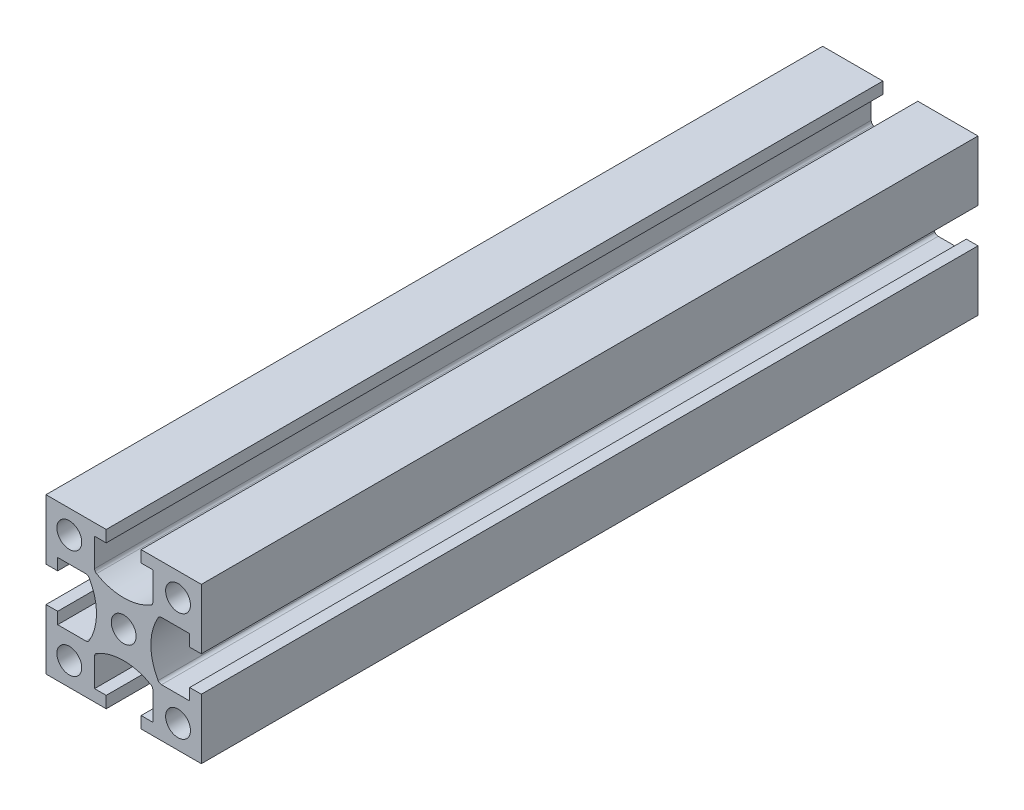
ISO-10303-21;
HEADER;
FILE_DESCRIPTION(('STEP AP214'),'2;1');
FILE_NAME('part.step','',(''),(''),'','','');
FILE_SCHEMA(('AUTOMOTIVE_DESIGN { 1 0 10303 214 1 1 1 1 }'));
ENDSEC;
DATA;
#1=APPLICATION_CONTEXT('core data for automotive mechanical design processes');
#2=APPLICATION_PROTOCOL_DEFINITION('international standard','automotive_design',2000,#1);
#3=PRODUCT_CONTEXT('',#1,'mechanical');
#4=PRODUCT('Part','Part','',(#3));
#5=PRODUCT_RELATED_PRODUCT_CATEGORY('part','',(#4));
#6=PRODUCT_DEFINITION_FORMATION('','',#4);
#7=PRODUCT_DEFINITION_CONTEXT('part definition',#1,'design');
#8=PRODUCT_DEFINITION('design','',#6,#7);
#9=PRODUCT_DEFINITION_SHAPE('','',#8);
#10=(LENGTH_UNIT() NAMED_UNIT(*) SI_UNIT(.MILLI.,.METRE.));
#11=(NAMED_UNIT(*) PLANE_ANGLE_UNIT() SI_UNIT($,.RADIAN.));
#12=(NAMED_UNIT(*) SI_UNIT($,.STERADIAN.) SOLID_ANGLE_UNIT());
#13=UNCERTAINTY_MEASURE_WITH_UNIT(LENGTH_MEASURE(1.E-05),#10,'distance_accuracy_value','');
#14=(GEOMETRIC_REPRESENTATION_CONTEXT(3) GLOBAL_UNCERTAINTY_ASSIGNED_CONTEXT((#13)) GLOBAL_UNIT_ASSIGNED_CONTEXT((#10,
#11,#12)) REPRESENTATION_CONTEXT('',''));
#15=CARTESIAN_POINT('',(0.,0.,0.));
#16=DIRECTION('',(0.,0.,1.));
#17=DIRECTION('',(1.,0.,0.));
#18=AXIS2_PLACEMENT_3D('',#15,#16,#17);
#19=CARTESIAN_POINT('',(4.87083487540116,3.25,50.));
#20=DIRECTION('',(0.,0.,1.));
#21=DIRECTION('',(1.,0.,0.));
#22=AXIS2_PLACEMENT_3D('',#19,#20,#21);
#23=PLANE('',#22);
#24=CARTESIAN_POINT('',(-7.00000000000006,-6.99999999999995,50.));
#25=DIRECTION('',(0.,0.,1.));
#26=DIRECTION('',(1.,0.,0.));
#27=AXIS2_PLACEMENT_3D('',#24,#25,#26);
#28=CIRCLE('',#27,1.6);
#29=CARTESIAN_POINT('',(-5.40000000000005,-6.99999999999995,50.));
#30=VERTEX_POINT('',#29);
#31=EDGE_CURVE('E716',#30,#30,#28,.T.);
#32=ORIENTED_EDGE('',*,*,#31,.F.);
#33=EDGE_LOOP('',(#32));
#34=FACE_BOUND('',#33,.T.);
#35=CARTESIAN_POINT('',(0.00141421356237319,2.80842032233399E-13,50.));
#36=DIRECTION('',(0.,0.,1.));
#37=DIRECTION('',(1.,0.,0.));
#38=AXIS2_PLACEMENT_3D('',#35,#36,#37);
#39=CIRCLE('',#38,1.6);
#40=CARTESIAN_POINT('',(1.60141421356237,2.80842032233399E-13,50.));
#41=VERTEX_POINT('',#40);
#42=EDGE_CURVE('E728',#41,#41,#39,.T.);
#43=ORIENTED_EDGE('',*,*,#42,.F.);
#44=EDGE_LOOP('',(#43));
#45=FACE_BOUND('',#44,.T.);
#46=DIRECTION('',(-1.,0.,0.));
#47=VECTOR('',#46,1.);
#48=CARTESIAN_POINT('',(2.25141421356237,10.,50.));
#49=LINE('',#48,#47);
#50=CARTESIAN_POINT('',(10.,10.,50.));
#51=VERTEX_POINT('',#50);
#52=CARTESIAN_POINT('',(2.25141421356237,10.,50.));
#53=VERTEX_POINT('',#52);
#54=EDGE_CURVE('E437',#51,#53,#49,.T.);
#55=ORIENTED_EDGE('',*,*,#54,.T.);
#56=DIRECTION('',(0.,-1.,0.));
#57=VECTOR('',#56,1.);
#58=CARTESIAN_POINT('',(2.25141421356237,10.,50.));
#59=LINE('',#58,#57);
#60=CARTESIAN_POINT('',(2.25141421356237,8.5,50.));
#61=VERTEX_POINT('',#60);
#62=EDGE_CURVE('E205',#53,#61,#59,.T.);
#63=ORIENTED_EDGE('',*,*,#62,.T.);
#64=DIRECTION('',(1.,0.,0.));
#65=VECTOR('',#64,1.);
#66=CARTESIAN_POINT('',(2.25141421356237,8.5,50.));
#67=LINE('',#66,#65);
#68=CARTESIAN_POINT('',(3.75141421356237,8.5,50.));
#69=VERTEX_POINT('',#68);
#70=EDGE_CURVE('E560',#61,#69,#67,.T.);
#71=ORIENTED_EDGE('',*,*,#70,.T.);
#72=DIRECTION('',(0.,-1.,0.));
#73=VECTOR('',#72,1.);
#74=CARTESIAN_POINT('',(3.75141421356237,8.5,50.));
#75=LINE('',#74,#73);
#76=CARTESIAN_POINT('',(3.75141421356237,4.87083487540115,50.));
#77=VERTEX_POINT('',#76);
#78=EDGE_CURVE('E579',#69,#77,#75,.T.);
#79=ORIENTED_EDGE('',*,*,#78,.T.);
#80=CARTESIAN_POINT('',(3.25141421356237,4.87083487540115,50.));
#81=DIRECTION('',(0.,0.,-1.));
#82=DIRECTION('',(-1.,0.,0.));
#83=AXIS2_PLACEMENT_3D('',#80,#81,#82);
#84=CIRCLE('',#83,0.5);
#85=CARTESIAN_POINT('',(3.50141421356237,4.43782217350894,50.));
#86=VERTEX_POINT('',#85);
#87=EDGE_CURVE('E576',#77,#86,#84,.T.);
#88=ORIENTED_EDGE('',*,*,#87,.T.);
#89=CARTESIAN_POINT('',(0.00141421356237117,10.5,50.));
#90=DIRECTION('',(0.,0.,-1.));
#91=DIRECTION('',(-1.,0.,0.));
#92=AXIS2_PLACEMENT_3D('',#89,#90,#91);
#93=CIRCLE('',#92,7.);
#94=CARTESIAN_POINT('',(-3.49858578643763,4.43782217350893,50.));
#95=VERTEX_POINT('',#94);
#96=EDGE_CURVE('E578',#86,#95,#93,.T.);
#97=ORIENTED_EDGE('',*,*,#96,.T.);
#98=CARTESIAN_POINT('',(-3.24858578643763,4.87083487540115,50.));
#99=DIRECTION('',(0.,0.,-1.));
#100=DIRECTION('',(1.,0.,0.));
#101=AXIS2_PLACEMENT_3D('',#98,#99,#100);
#102=CIRCLE('',#101,0.5);
#103=CARTESIAN_POINT('',(-3.74858578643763,4.87083487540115,50.));
#104=VERTEX_POINT('',#103);
#105=EDGE_CURVE('E581',#95,#104,#102,.T.);
#106=ORIENTED_EDGE('',*,*,#105,.T.);
#107=DIRECTION('',(0.,1.,0.));
#108=VECTOR('',#107,1.);
#109=CARTESIAN_POINT('',(-3.74858578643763,8.5,50.));
#110=LINE('',#109,#108);
#111=CARTESIAN_POINT('',(-3.74858578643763,8.5,50.));
#112=VERTEX_POINT('',#111);
#113=EDGE_CURVE('E587',#104,#112,#110,.T.);
#114=ORIENTED_EDGE('',*,*,#113,.T.);
#115=DIRECTION('',(1.,0.,0.));
#116=VECTOR('',#115,1.);
#117=CARTESIAN_POINT('',(-2.24858578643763,8.5,50.));
#118=LINE('',#117,#116);
#119=CARTESIAN_POINT('',(-2.24858578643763,8.5,50.));
#120=VERTEX_POINT('',#119);
#121=EDGE_CURVE('E589',#112,#120,#118,.T.);
#122=ORIENTED_EDGE('',*,*,#121,.T.);
#123=DIRECTION('',(0.,1.,0.));
#124=VECTOR('',#123,1.);
#125=CARTESIAN_POINT('',(-2.24858578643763,10.,50.));
#126=LINE('',#125,#124);
#127=CARTESIAN_POINT('',(-2.24858578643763,10.,50.));
#128=VERTEX_POINT('',#127);
#129=EDGE_CURVE('E591',#120,#128,#126,.T.);
#130=ORIENTED_EDGE('',*,*,#129,.T.);
#131=DIRECTION('',(-1.,0.,0.));
#132=VECTOR('',#131,1.);
#133=CARTESIAN_POINT('',(-9.99999999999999,10.,50.));
#134=LINE('',#133,#132);
#135=CARTESIAN_POINT('',(-9.99999999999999,10.,50.));
#136=VERTEX_POINT('',#135);
#137=EDGE_CURVE('E593',#128,#136,#134,.T.);
#138=ORIENTED_EDGE('',*,*,#137,.T.);
#139=DIRECTION('',(0.,-1.,0.));
#140=VECTOR('',#139,1.);
#141=CARTESIAN_POINT('',(-9.99999999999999,10.,50.));
#142=LINE('',#141,#140);
#143=CARTESIAN_POINT('',(-9.99999999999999,2.25,50.));
#144=VERTEX_POINT('',#143);
#145=EDGE_CURVE('E595',#136,#144,#142,.T.);
#146=ORIENTED_EDGE('',*,*,#145,.T.);
#147=DIRECTION('',(1.,0.,0.));
#148=VECTOR('',#147,1.);
#149=CARTESIAN_POINT('',(-9.99999999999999,2.25,50.));
#150=LINE('',#149,#148);
#151=CARTESIAN_POINT('',(-8.49999999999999,2.25,50.));
#152=VERTEX_POINT('',#151);
#153=EDGE_CURVE('E597',#144,#152,#150,.T.);
#154=ORIENTED_EDGE('',*,*,#153,.T.);
#155=DIRECTION('',(0.,1.,0.));
#156=VECTOR('',#155,1.);
#157=CARTESIAN_POINT('',(-8.49999999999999,2.25,50.));
#158=LINE('',#157,#156);
#159=CARTESIAN_POINT('',(-8.5,3.75,50.));
#160=VERTEX_POINT('',#159);
#161=EDGE_CURVE('E599',#152,#160,#158,.T.);
#162=ORIENTED_EDGE('',*,*,#161,.T.);
#163=DIRECTION('',(1.,0.,0.));
#164=VECTOR('',#163,1.);
#165=CARTESIAN_POINT('',(-8.5,3.75,50.));
#166=LINE('',#165,#164);
#167=CARTESIAN_POINT('',(-4.87083487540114,3.75,50.));
#168=VERTEX_POINT('',#167);
#169=EDGE_CURVE('E601',#160,#168,#166,.T.);
#170=ORIENTED_EDGE('',*,*,#169,.T.);
#171=CARTESIAN_POINT('',(-4.87083487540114,3.25,50.));
#172=DIRECTION('',(0.,0.,-1.));
#173=DIRECTION('',(-1.,0.,0.));
#174=AXIS2_PLACEMENT_3D('',#171,#172,#173);
#175=CIRCLE('',#174,0.5);
#176=CARTESIAN_POINT('',(-4.43782217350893,3.5,50.));
#177=VERTEX_POINT('',#176);
#178=EDGE_CURVE('E603',#168,#177,#175,.T.);
#179=ORIENTED_EDGE('',*,*,#178,.T.);
#180=CARTESIAN_POINT('',(-10.5,0.,50.));
#181=DIRECTION('',(0.,0.,-1.));
#182=DIRECTION('',(-1.,0.,0.));
#183=AXIS2_PLACEMENT_3D('',#180,#181,#182);
#184=CIRCLE('',#183,7.);
#185=CARTESIAN_POINT('',(-4.43782217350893,-3.5,50.));
#186=VERTEX_POINT('',#185);
#187=EDGE_CURVE('E605',#177,#186,#184,.T.);
#188=ORIENTED_EDGE('',*,*,#187,.T.);
#189=CARTESIAN_POINT('',(-4.87083487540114,-3.25,50.));
#190=DIRECTION('',(0.,0.,-1.));
#191=DIRECTION('',(1.,0.,0.));
#192=AXIS2_PLACEMENT_3D('',#189,#190,#191);
#193=CIRCLE('',#192,0.5);
#194=CARTESIAN_POINT('',(-4.87083487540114,-3.75,50.));
#195=VERTEX_POINT('',#194);
#196=EDGE_CURVE('E607',#186,#195,#193,.T.);
#197=ORIENTED_EDGE('',*,*,#196,.T.);
#198=DIRECTION('',(-1.,0.,0.));
#199=VECTOR('',#198,1.);
#200=CARTESIAN_POINT('',(-8.5,-3.75,50.));
#201=LINE('',#200,#199);
#202=CARTESIAN_POINT('',(-8.5,-3.75,50.));
#203=VERTEX_POINT('',#202);
#204=EDGE_CURVE('E609',#195,#203,#201,.T.);
#205=ORIENTED_EDGE('',*,*,#204,.T.);
#206=DIRECTION('',(0.,1.,0.));
#207=VECTOR('',#206,1.);
#208=CARTESIAN_POINT('',(-8.49999999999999,-2.25,50.));
#209=LINE('',#208,#207);
#210=CARTESIAN_POINT('',(-8.49999999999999,-2.25,50.));
#211=VERTEX_POINT('',#210);
#212=EDGE_CURVE('E611',#203,#211,#209,.T.);
#213=ORIENTED_EDGE('',*,*,#212,.T.);
#214=DIRECTION('',(-1.,0.,0.));
#215=VECTOR('',#214,1.);
#216=CARTESIAN_POINT('',(-9.99999999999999,-2.25,50.));
#217=LINE('',#216,#215);
#218=CARTESIAN_POINT('',(-9.99999999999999,-2.25,50.));
#219=VERTEX_POINT('',#218);
#220=EDGE_CURVE('E613',#211,#219,#217,.T.);
#221=ORIENTED_EDGE('',*,*,#220,.T.);
#222=DIRECTION('',(0.,-1.,0.));
#223=VECTOR('',#222,1.);
#224=CARTESIAN_POINT('',(-9.99999999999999,-10.,50.));
#225=LINE('',#224,#223);
#226=CARTESIAN_POINT('',(-9.99999999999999,-10.,50.));
#227=VERTEX_POINT('',#226);
#228=EDGE_CURVE('E615',#219,#227,#225,.T.);
#229=ORIENTED_EDGE('',*,*,#228,.T.);
#230=DIRECTION('',(1.,0.,0.));
#231=VECTOR('',#230,1.);
#232=CARTESIAN_POINT('',(-9.99999999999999,-10.,50.));
#233=LINE('',#232,#231);
#234=CARTESIAN_POINT('',(-2.24858578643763,-10.,50.));
#235=VERTEX_POINT('',#234);
#236=EDGE_CURVE('E617',#227,#235,#233,.T.);
#237=ORIENTED_EDGE('',*,*,#236,.T.);
#238=DIRECTION('',(0.,1.,0.));
#239=VECTOR('',#238,1.);
#240=CARTESIAN_POINT('',(-2.24858578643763,-10.,50.));
#241=LINE('',#240,#239);
#242=CARTESIAN_POINT('',(-2.24858578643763,-8.5,50.));
#243=VERTEX_POINT('',#242);
#244=EDGE_CURVE('E619',#235,#243,#241,.T.);
#245=ORIENTED_EDGE('',*,*,#244,.T.);
#246=DIRECTION('',(-1.,0.,0.));
#247=VECTOR('',#246,1.);
#248=CARTESIAN_POINT('',(-2.24858578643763,-8.5,50.));
#249=LINE('',#248,#247);
#250=CARTESIAN_POINT('',(-3.74858578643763,-8.5,50.));
#251=VERTEX_POINT('',#250);
#252=EDGE_CURVE('E621',#243,#251,#249,.T.);
#253=ORIENTED_EDGE('',*,*,#252,.T.);
#254=DIRECTION('',(0.,1.,0.));
#255=VECTOR('',#254,1.);
#256=CARTESIAN_POINT('',(-3.74858578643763,-8.5,50.));
#257=LINE('',#256,#255);
#258=CARTESIAN_POINT('',(-3.74858578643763,-4.87083487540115,50.));
#259=VERTEX_POINT('',#258);
#260=EDGE_CURVE('E623',#251,#259,#257,.T.);
#261=ORIENTED_EDGE('',*,*,#260,.T.);
#262=CARTESIAN_POINT('',(-3.24858578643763,-4.87083487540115,50.));
#263=DIRECTION('',(0.,0.,-1.));
#264=DIRECTION('',(-1.,0.,0.));
#265=AXIS2_PLACEMENT_3D('',#262,#263,#264);
#266=CIRCLE('',#265,0.5);
#267=CARTESIAN_POINT('',(-3.49858578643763,-4.43782217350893,50.));
#268=VERTEX_POINT('',#267);
#269=EDGE_CURVE('E625',#259,#268,#266,.T.);
#270=ORIENTED_EDGE('',*,*,#269,.T.);
#271=CARTESIAN_POINT('',(0.00141421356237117,-10.5,50.));
#272=DIRECTION('',(0.,0.,-1.));
#273=DIRECTION('',(1.,0.,0.));
#274=AXIS2_PLACEMENT_3D('',#271,#272,#273);
#275=CIRCLE('',#274,7.);
#276=CARTESIAN_POINT('',(3.50141421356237,-4.43782217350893,50.));
#277=VERTEX_POINT('',#276);
#278=EDGE_CURVE('E627',#268,#277,#275,.T.);
#279=ORIENTED_EDGE('',*,*,#278,.T.);
#280=CARTESIAN_POINT('',(3.25141421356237,-4.87083487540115,50.));
#281=DIRECTION('',(0.,0.,-1.));
#282=DIRECTION('',(1.,0.,0.));
#283=AXIS2_PLACEMENT_3D('',#280,#281,#282);
#284=CIRCLE('',#283,0.5);
#285=CARTESIAN_POINT('',(3.75141421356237,-4.87083487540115,50.));
#286=VERTEX_POINT('',#285);
#287=EDGE_CURVE('E629',#277,#286,#284,.T.);
#288=ORIENTED_EDGE('',*,*,#287,.T.);
#289=DIRECTION('',(0.,-1.,0.));
#290=VECTOR('',#289,1.);
#291=CARTESIAN_POINT('',(3.75141421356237,-8.5,50.));
#292=LINE('',#291,#290);
#293=CARTESIAN_POINT('',(3.75141421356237,-8.5,50.));
#294=VERTEX_POINT('',#293);
#295=EDGE_CURVE('E631',#286,#294,#292,.T.);
#296=ORIENTED_EDGE('',*,*,#295,.T.);
#297=DIRECTION('',(-1.,0.,0.));
#298=VECTOR('',#297,1.);
#299=CARTESIAN_POINT('',(2.25141421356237,-8.5,50.));
#300=LINE('',#299,#298);
#301=CARTESIAN_POINT('',(2.25141421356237,-8.5,50.));
#302=VERTEX_POINT('',#301);
#303=EDGE_CURVE('E633',#294,#302,#300,.T.);
#304=ORIENTED_EDGE('',*,*,#303,.T.);
#305=DIRECTION('',(0.,-1.,0.));
#306=VECTOR('',#305,1.);
#307=CARTESIAN_POINT('',(2.25141421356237,-10.,50.));
#308=LINE('',#307,#306);
#309=CARTESIAN_POINT('',(2.25141421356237,-10.,50.));
#310=VERTEX_POINT('',#309);
#311=EDGE_CURVE('E635',#302,#310,#308,.T.);
#312=ORIENTED_EDGE('',*,*,#311,.T.);
#313=DIRECTION('',(1.,0.,0.));
#314=VECTOR('',#313,1.);
#315=CARTESIAN_POINT('',(2.25141421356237,-10.,50.));
#316=LINE('',#315,#314);
#317=CARTESIAN_POINT('',(10.,-10.,50.));
#318=VERTEX_POINT('',#317);
#319=EDGE_CURVE('E637',#310,#318,#316,.T.);
#320=ORIENTED_EDGE('',*,*,#319,.T.);
#321=DIRECTION('',(0.,1.,0.));
#322=VECTOR('',#321,1.);
#323=CARTESIAN_POINT('',(10.,-10.,50.));
#324=LINE('',#323,#322);
#325=CARTESIAN_POINT('',(10.,-2.25,50.));
#326=VERTEX_POINT('',#325);
#327=EDGE_CURVE('E639',#318,#326,#324,.T.);
#328=ORIENTED_EDGE('',*,*,#327,.T.);
#329=DIRECTION('',(-1.,0.,0.));
#330=VECTOR('',#329,1.);
#331=CARTESIAN_POINT('',(10.,-2.25,50.));
#332=LINE('',#331,#330);
#333=CARTESIAN_POINT('',(8.50000000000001,-2.25,50.));
#334=VERTEX_POINT('',#333);
#335=EDGE_CURVE('E641',#326,#334,#332,.T.);
#336=ORIENTED_EDGE('',*,*,#335,.T.);
#337=DIRECTION('',(0.,-1.,0.));
#338=VECTOR('',#337,1.);
#339=CARTESIAN_POINT('',(8.50000000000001,-2.25,50.));
#340=LINE('',#339,#338);
#341=CARTESIAN_POINT('',(8.50000000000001,-3.75,50.));
#342=VERTEX_POINT('',#341);
#343=EDGE_CURVE('E643',#334,#342,#340,.T.);
#344=ORIENTED_EDGE('',*,*,#343,.T.);
#345=DIRECTION('',(-1.,0.,0.));
#346=VECTOR('',#345,1.);
#347=CARTESIAN_POINT('',(8.50000000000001,-3.75,50.));
#348=LINE('',#347,#346);
#349=CARTESIAN_POINT('',(4.87083487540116,-3.75,50.));
#350=VERTEX_POINT('',#349);
#351=EDGE_CURVE('E645',#342,#350,#348,.T.);
#352=ORIENTED_EDGE('',*,*,#351,.T.);
#353=CARTESIAN_POINT('',(4.87083487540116,-3.25,50.));
#354=DIRECTION('',(0.,0.,-1.));
#355=DIRECTION('',(-1.,0.,0.));
#356=AXIS2_PLACEMENT_3D('',#353,#354,#355);
#357=CIRCLE('',#356,0.5);
#358=CARTESIAN_POINT('',(4.43782217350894,-3.5,50.));
#359=VERTEX_POINT('',#358);
#360=EDGE_CURVE('E647',#350,#359,#357,.T.);
#361=ORIENTED_EDGE('',*,*,#360,.T.);
#362=CARTESIAN_POINT('',(10.5,0.,50.));
#363=DIRECTION('',(0.,0.,-1.));
#364=DIRECTION('',(1.,0.,0.));
#365=AXIS2_PLACEMENT_3D('',#362,#363,#364);
#366=CIRCLE('',#365,7.);
#367=CARTESIAN_POINT('',(4.43782217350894,3.5,50.));
#368=VERTEX_POINT('',#367);
#369=EDGE_CURVE('E649',#359,#368,#366,.T.);
#370=ORIENTED_EDGE('',*,*,#369,.T.);
#371=CARTESIAN_POINT('',(4.87083487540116,3.25,50.));
#372=DIRECTION('',(0.,0.,-1.));
#373=DIRECTION('',(1.,0.,0.));
#374=AXIS2_PLACEMENT_3D('',#371,#372,#373);
#375=CIRCLE('',#374,0.5);
#376=CARTESIAN_POINT('',(4.87083487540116,3.75,50.));
#377=VERTEX_POINT('',#376);
#378=EDGE_CURVE('E651',#368,#377,#375,.T.);
#379=ORIENTED_EDGE('',*,*,#378,.T.);
#380=DIRECTION('',(1.,0.,0.));
#381=VECTOR('',#380,1.);
#382=CARTESIAN_POINT('',(8.50000000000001,3.75,50.));
#383=LINE('',#382,#381);
#384=CARTESIAN_POINT('',(8.50000000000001,3.75,50.));
#385=VERTEX_POINT('',#384);
#386=EDGE_CURVE('E332',#377,#385,#383,.T.);
#387=ORIENTED_EDGE('',*,*,#386,.T.);
#388=DIRECTION('',(0.,-1.,0.));
#389=VECTOR('',#388,1.);
#390=CARTESIAN_POINT('',(8.50000000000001,2.25,50.));
#391=LINE('',#390,#389);
#392=CARTESIAN_POINT('',(8.50000000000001,2.25,50.));
#393=VERTEX_POINT('',#392);
#394=EDGE_CURVE('E326',#385,#393,#391,.T.);
#395=ORIENTED_EDGE('',*,*,#394,.T.);
#396=DIRECTION('',(1.,0.,0.));
#397=VECTOR('',#396,1.);
#398=CARTESIAN_POINT('',(10.,2.25,50.));
#399=LINE('',#398,#397);
#400=CARTESIAN_POINT('',(10.,2.25,50.));
#401=VERTEX_POINT('',#400);
#402=EDGE_CURVE('E330',#393,#401,#399,.T.);
#403=ORIENTED_EDGE('',*,*,#402,.T.);
#404=DIRECTION('',(0.,1.,0.));
#405=VECTOR('',#404,1.);
#406=CARTESIAN_POINT('',(10.,10.,50.));
#407=LINE('',#406,#405);
#408=EDGE_CURVE('E54',#401,#51,#407,.T.);
#409=ORIENTED_EDGE('',*,*,#408,.T.);
#410=EDGE_LOOP('',(#55,#63,#71,#79,#88,#97,#106,#114,#122,#130,#138,#146,#154,#162,#170,#179,
#188,#197,#205,#213,#221,#229,#237,#245,#253,#261,#270,#279,#288,#296,#304,#312,#320,#328,#336,
#344,#352,#361,#370,#379,#387,#395,#403,#409));
#411=FACE_BOUND('',#410,.T.);
#412=CARTESIAN_POINT('',(7.00000000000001,7.,50.));
#413=DIRECTION('',(0.,0.,1.));
#414=DIRECTION('',(1.,0.,0.));
#415=AXIS2_PLACEMENT_3D('',#412,#413,#414);
#416=CIRCLE('',#415,1.6);
#417=CARTESIAN_POINT('',(8.60000000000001,7.,50.));
#418=VERTEX_POINT('',#417);
#419=EDGE_CURVE('E354',#418,#418,#416,.T.);
#420=ORIENTED_EDGE('',*,*,#419,.F.);
#421=EDGE_LOOP('',(#420));
#422=FACE_BOUND('',#421,.T.);
#423=CARTESIAN_POINT('',(6.99999999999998,-7.00000000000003,50.));
#424=DIRECTION('',(0.,0.,1.));
#425=DIRECTION('',(1.,0.,0.));
#426=AXIS2_PLACEMENT_3D('',#423,#424,#425);
#427=CIRCLE('',#426,1.6);
#428=CARTESIAN_POINT('',(8.59999999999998,-7.00000000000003,50.));
#429=VERTEX_POINT('',#428);
#430=EDGE_CURVE('E722',#429,#429,#427,.T.);
#431=ORIENTED_EDGE('',*,*,#430,.F.);
#432=EDGE_LOOP('',(#431));
#433=FACE_BOUND('',#432,.T.);
#434=CARTESIAN_POINT('',(-6.99999999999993,7.00000000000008,50.));
#435=DIRECTION('',(0.,0.,1.));
#436=DIRECTION('',(1.,0.,0.));
#437=AXIS2_PLACEMENT_3D('',#434,#435,#436);
#438=CIRCLE('',#437,1.6);
#439=CARTESIAN_POINT('',(-5.39999999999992,7.00000000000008,50.));
#440=VERTEX_POINT('',#439);
#441=EDGE_CURVE('E707',#440,#440,#438,.T.);
#442=ORIENTED_EDGE('',*,*,#441,.F.);
#443=EDGE_LOOP('',(#442));
#444=FACE_BOUND('',#443,.T.);
#445=ADVANCED_FACE('F37',(#34,#45,#411,#422,#433,#444),#23,.T.);
#446=CARTESIAN_POINT('',(4.87083487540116,3.25,-50.));
#447=DIRECTION('',(0.,0.,1.));
#448=DIRECTION('',(1.,0.,0.));
#449=AXIS2_PLACEMENT_3D('',#446,#447,#448);
#450=PLANE('',#449);
#451=CARTESIAN_POINT('',(-7.00000000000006,-6.99999999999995,-50.));
#452=DIRECTION('',(0.,0.,1.));
#453=DIRECTION('',(1.,0.,0.));
#454=AXIS2_PLACEMENT_3D('',#451,#452,#453);
#455=CIRCLE('',#454,1.6);
#456=CARTESIAN_POINT('',(-5.40000000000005,-6.99999999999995,-50.));
#457=VERTEX_POINT('',#456);
#458=EDGE_CURVE('E713',#457,#457,#455,.T.);
#459=ORIENTED_EDGE('',*,*,#458,.T.);
#460=EDGE_LOOP('',(#459));
#461=FACE_BOUND('',#460,.T.);
#462=CARTESIAN_POINT('',(0.00141421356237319,2.80842032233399E-13,-50.));
#463=DIRECTION('',(0.,0.,1.));
#464=DIRECTION('',(1.,0.,0.));
#465=AXIS2_PLACEMENT_3D('',#462,#463,#464);
#466=CIRCLE('',#465,1.6);
#467=CARTESIAN_POINT('',(1.60141421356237,2.80842032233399E-13,-50.));
#468=VERTEX_POINT('',#467);
#469=EDGE_CURVE('E725',#468,#468,#466,.T.);
#470=ORIENTED_EDGE('',*,*,#469,.T.);
#471=EDGE_LOOP('',(#470));
#472=FACE_BOUND('',#471,.T.);
#473=DIRECTION('',(-1.,0.,0.));
#474=VECTOR('',#473,1.);
#475=CARTESIAN_POINT('',(2.25141421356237,10.,-50.));
#476=LINE('',#475,#474);
#477=CARTESIAN_POINT('',(10.,10.,-50.));
#478=VERTEX_POINT('',#477);
#479=CARTESIAN_POINT('',(2.25141421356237,10.,-50.));
#480=VERTEX_POINT('',#479);
#481=EDGE_CURVE('E350',#478,#480,#476,.T.);
#482=ORIENTED_EDGE('',*,*,#481,.F.);
#483=DIRECTION('',(0.,1.,0.));
#484=VECTOR('',#483,1.);
#485=CARTESIAN_POINT('',(10.,10.,-50.));
#486=LINE('',#485,#484);
#487=CARTESIAN_POINT('',(10.,2.25,-50.));
#488=VERTEX_POINT('',#487);
#489=EDGE_CURVE('E197',#488,#478,#486,.T.);
#490=ORIENTED_EDGE('',*,*,#489,.F.);
#491=DIRECTION('',(1.,0.,0.));
#492=VECTOR('',#491,1.);
#493=CARTESIAN_POINT('',(10.,2.25,-50.));
#494=LINE('',#493,#492);
#495=CARTESIAN_POINT('',(8.50000000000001,2.25,-50.));
#496=VERTEX_POINT('',#495);
#497=EDGE_CURVE('E191',#496,#488,#494,.T.);
#498=ORIENTED_EDGE('',*,*,#497,.F.);
#499=DIRECTION('',(0.,-1.,0.));
#500=VECTOR('',#499,1.);
#501=CARTESIAN_POINT('',(8.50000000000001,2.25,-50.));
#502=LINE('',#501,#500);
#503=CARTESIAN_POINT('',(8.50000000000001,3.75,-50.));
#504=VERTEX_POINT('',#503);
#505=EDGE_CURVE('E340',#504,#496,#502,.T.);
#506=ORIENTED_EDGE('',*,*,#505,.F.);
#507=DIRECTION('',(1.,0.,0.));
#508=VECTOR('',#507,1.);
#509=CARTESIAN_POINT('',(8.50000000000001,3.75,-50.));
#510=LINE('',#509,#508);
#511=CARTESIAN_POINT('',(4.87083487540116,3.75,-50.));
#512=VERTEX_POINT('',#511);
#513=EDGE_CURVE('E432',#512,#504,#510,.T.);
#514=ORIENTED_EDGE('',*,*,#513,.F.);
#515=CARTESIAN_POINT('',(4.87083487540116,3.25,-50.));
#516=DIRECTION('',(0.,0.,-1.));
#517=DIRECTION('',(1.,0.,0.));
#518=AXIS2_PLACEMENT_3D('',#515,#516,#517);
#519=CIRCLE('',#518,0.5);
#520=CARTESIAN_POINT('',(4.43782217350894,3.5,-50.));
#521=VERTEX_POINT('',#520);
#522=EDGE_CURVE('E430',#521,#512,#519,.T.);
#523=ORIENTED_EDGE('',*,*,#522,.F.);
#524=CARTESIAN_POINT('',(10.5,0.,-50.));
#525=DIRECTION('',(0.,0.,-1.));
#526=DIRECTION('',(1.,0.,0.));
#527=AXIS2_PLACEMENT_3D('',#524,#525,#526);
#528=CIRCLE('',#527,7.);
#529=CARTESIAN_POINT('',(4.43782217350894,-3.5,-50.));
#530=VERTEX_POINT('',#529);
#531=EDGE_CURVE('E428',#530,#521,#528,.T.);
#532=ORIENTED_EDGE('',*,*,#531,.F.);
#533=CARTESIAN_POINT('',(4.87083487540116,-3.25,-50.));
#534=DIRECTION('',(0.,0.,-1.));
#535=DIRECTION('',(-1.,0.,0.));
#536=AXIS2_PLACEMENT_3D('',#533,#534,#535);
#537=CIRCLE('',#536,0.5);
#538=CARTESIAN_POINT('',(4.87083487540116,-3.75,-50.));
#539=VERTEX_POINT('',#538);
#540=EDGE_CURVE('E426',#539,#530,#537,.T.);
#541=ORIENTED_EDGE('',*,*,#540,.F.);
#542=DIRECTION('',(-1.,0.,0.));
#543=VECTOR('',#542,1.);
#544=CARTESIAN_POINT('',(8.50000000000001,-3.75,-50.));
#545=LINE('',#544,#543);
#546=CARTESIAN_POINT('',(8.50000000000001,-3.75,-50.));
#547=VERTEX_POINT('',#546);
#548=EDGE_CURVE('E424',#547,#539,#545,.T.);
#549=ORIENTED_EDGE('',*,*,#548,.F.);
#550=DIRECTION('',(0.,-1.,0.));
#551=VECTOR('',#550,1.);
#552=CARTESIAN_POINT('',(8.50000000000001,-2.25,-50.));
#553=LINE('',#552,#551);
#554=CARTESIAN_POINT('',(8.50000000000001,-2.25,-50.));
#555=VERTEX_POINT('',#554);
#556=EDGE_CURVE('E422',#555,#547,#553,.T.);
#557=ORIENTED_EDGE('',*,*,#556,.F.);
#558=DIRECTION('',(-1.,0.,0.));
#559=VECTOR('',#558,1.);
#560=CARTESIAN_POINT('',(10.,-2.25,-50.));
#561=LINE('',#560,#559);
#562=CARTESIAN_POINT('',(10.,-2.25,-50.));
#563=VERTEX_POINT('',#562);
#564=EDGE_CURVE('E420',#563,#555,#561,.T.);
#565=ORIENTED_EDGE('',*,*,#564,.F.);
#566=DIRECTION('',(0.,1.,0.));
#567=VECTOR('',#566,1.);
#568=CARTESIAN_POINT('',(10.,-10.,-50.));
#569=LINE('',#568,#567);
#570=CARTESIAN_POINT('',(10.,-10.,-50.));
#571=VERTEX_POINT('',#570);
#572=EDGE_CURVE('E418',#571,#563,#569,.T.);
#573=ORIENTED_EDGE('',*,*,#572,.F.);
#574=DIRECTION('',(1.,0.,0.));
#575=VECTOR('',#574,1.);
#576=CARTESIAN_POINT('',(2.25141421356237,-10.,-50.));
#577=LINE('',#576,#575);
#578=CARTESIAN_POINT('',(2.25141421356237,-10.,-50.));
#579=VERTEX_POINT('',#578);
#580=EDGE_CURVE('E416',#579,#571,#577,.T.);
#581=ORIENTED_EDGE('',*,*,#580,.F.);
#582=DIRECTION('',(0.,-1.,0.));
#583=VECTOR('',#582,1.);
#584=CARTESIAN_POINT('',(2.25141421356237,-10.,-50.));
#585=LINE('',#584,#583);
#586=CARTESIAN_POINT('',(2.25141421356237,-8.5,-50.));
#587=VERTEX_POINT('',#586);
#588=EDGE_CURVE('E414',#587,#579,#585,.T.);
#589=ORIENTED_EDGE('',*,*,#588,.F.);
#590=DIRECTION('',(-1.,0.,0.));
#591=VECTOR('',#590,1.);
#592=CARTESIAN_POINT('',(2.25141421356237,-8.5,-50.));
#593=LINE('',#592,#591);
#594=CARTESIAN_POINT('',(3.75141421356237,-8.5,-50.));
#595=VERTEX_POINT('',#594);
#596=EDGE_CURVE('E412',#595,#587,#593,.T.);
#597=ORIENTED_EDGE('',*,*,#596,.F.);
#598=DIRECTION('',(0.,-1.,0.));
#599=VECTOR('',#598,1.);
#600=CARTESIAN_POINT('',(3.75141421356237,-8.5,-50.));
#601=LINE('',#600,#599);
#602=CARTESIAN_POINT('',(3.75141421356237,-4.87083487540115,-50.));
#603=VERTEX_POINT('',#602);
#604=EDGE_CURVE('E410',#603,#595,#601,.T.);
#605=ORIENTED_EDGE('',*,*,#604,.F.);
#606=CARTESIAN_POINT('',(3.25141421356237,-4.87083487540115,-50.));
#607=DIRECTION('',(0.,0.,-1.));
#608=DIRECTION('',(1.,0.,0.));
#609=AXIS2_PLACEMENT_3D('',#606,#607,#608);
#610=CIRCLE('',#609,0.5);
#611=CARTESIAN_POINT('',(3.50141421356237,-4.43782217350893,-50.));
#612=VERTEX_POINT('',#611);
#613=EDGE_CURVE('E408',#612,#603,#610,.T.);
#614=ORIENTED_EDGE('',*,*,#613,.F.);
#615=CARTESIAN_POINT('',(0.00141421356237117,-10.5,-50.));
#616=DIRECTION('',(0.,0.,-1.));
#617=DIRECTION('',(1.,0.,0.));
#618=AXIS2_PLACEMENT_3D('',#615,#616,#617);
#619=CIRCLE('',#618,7.);
#620=CARTESIAN_POINT('',(-3.49858578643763,-4.43782217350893,-50.));
#621=VERTEX_POINT('',#620);
#622=EDGE_CURVE('E406',#621,#612,#619,.T.);
#623=ORIENTED_EDGE('',*,*,#622,.F.);
#624=CARTESIAN_POINT('',(-3.24858578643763,-4.87083487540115,-50.));
#625=DIRECTION('',(0.,0.,-1.));
#626=DIRECTION('',(-1.,0.,0.));
#627=AXIS2_PLACEMENT_3D('',#624,#625,#626);
#628=CIRCLE('',#627,0.5);
#629=CARTESIAN_POINT('',(-3.74858578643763,-4.87083487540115,-50.));
#630=VERTEX_POINT('',#629);
#631=EDGE_CURVE('E404',#630,#621,#628,.T.);
#632=ORIENTED_EDGE('',*,*,#631,.F.);
#633=DIRECTION('',(0.,1.,0.));
#634=VECTOR('',#633,1.);
#635=CARTESIAN_POINT('',(-3.74858578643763,-8.5,-50.));
#636=LINE('',#635,#634);
#637=CARTESIAN_POINT('',(-3.74858578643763,-8.5,-50.));
#638=VERTEX_POINT('',#637);
#639=EDGE_CURVE('E402',#638,#630,#636,.T.);
#640=ORIENTED_EDGE('',*,*,#639,.F.);
#641=DIRECTION('',(-1.,0.,0.));
#642=VECTOR('',#641,1.);
#643=CARTESIAN_POINT('',(-2.24858578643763,-8.5,-50.));
#644=LINE('',#643,#642);
#645=CARTESIAN_POINT('',(-2.24858578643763,-8.5,-50.));
#646=VERTEX_POINT('',#645);
#647=EDGE_CURVE('E400',#646,#638,#644,.T.);
#648=ORIENTED_EDGE('',*,*,#647,.F.);
#649=DIRECTION('',(0.,1.,0.));
#650=VECTOR('',#649,1.);
#651=CARTESIAN_POINT('',(-2.24858578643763,-10.,-50.));
#652=LINE('',#651,#650);
#653=CARTESIAN_POINT('',(-2.24858578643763,-10.,-50.));
#654=VERTEX_POINT('',#653);
#655=EDGE_CURVE('E398',#654,#646,#652,.T.);
#656=ORIENTED_EDGE('',*,*,#655,.F.);
#657=DIRECTION('',(1.,0.,0.));
#658=VECTOR('',#657,1.);
#659=CARTESIAN_POINT('',(-9.99999999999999,-10.,-50.));
#660=LINE('',#659,#658);
#661=CARTESIAN_POINT('',(-9.99999999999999,-10.,-50.));
#662=VERTEX_POINT('',#661);
#663=EDGE_CURVE('E396',#662,#654,#660,.T.);
#664=ORIENTED_EDGE('',*,*,#663,.F.);
#665=DIRECTION('',(0.,-1.,0.));
#666=VECTOR('',#665,1.);
#667=CARTESIAN_POINT('',(-9.99999999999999,-10.,-50.));
#668=LINE('',#667,#666);
#669=CARTESIAN_POINT('',(-9.99999999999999,-2.25,-50.));
#670=VERTEX_POINT('',#669);
#671=EDGE_CURVE('E394',#670,#662,#668,.T.);
#672=ORIENTED_EDGE('',*,*,#671,.F.);
#673=DIRECTION('',(-1.,0.,0.));
#674=VECTOR('',#673,1.);
#675=CARTESIAN_POINT('',(-9.99999999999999,-2.25,-50.));
#676=LINE('',#675,#674);
#677=CARTESIAN_POINT('',(-8.49999999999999,-2.25,-50.));
#678=VERTEX_POINT('',#677);
#679=EDGE_CURVE('E392',#678,#670,#676,.T.);
#680=ORIENTED_EDGE('',*,*,#679,.F.);
#681=DIRECTION('',(0.,1.,0.));
#682=VECTOR('',#681,1.);
#683=CARTESIAN_POINT('',(-8.49999999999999,-2.25,-50.));
#684=LINE('',#683,#682);
#685=CARTESIAN_POINT('',(-8.5,-3.75,-50.));
#686=VERTEX_POINT('',#685);
#687=EDGE_CURVE('E390',#686,#678,#684,.T.);
#688=ORIENTED_EDGE('',*,*,#687,.F.);
#689=DIRECTION('',(-1.,0.,0.));
#690=VECTOR('',#689,1.);
#691=CARTESIAN_POINT('',(-8.5,-3.75,-50.));
#692=LINE('',#691,#690);
#693=CARTESIAN_POINT('',(-4.87083487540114,-3.75,-50.));
#694=VERTEX_POINT('',#693);
#695=EDGE_CURVE('E388',#694,#686,#692,.T.);
#696=ORIENTED_EDGE('',*,*,#695,.F.);
#697=CARTESIAN_POINT('',(-4.87083487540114,-3.25,-50.));
#698=DIRECTION('',(0.,0.,-1.));
#699=DIRECTION('',(1.,0.,0.));
#700=AXIS2_PLACEMENT_3D('',#697,#698,#699);
#701=CIRCLE('',#700,0.5);
#702=CARTESIAN_POINT('',(-4.43782217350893,-3.5,-50.));
#703=VERTEX_POINT('',#702);
#704=EDGE_CURVE('E386',#703,#694,#701,.T.);
#705=ORIENTED_EDGE('',*,*,#704,.F.);
#706=CARTESIAN_POINT('',(-10.5,0.,-50.));
#707=DIRECTION('',(0.,0.,-1.));
#708=DIRECTION('',(-1.,0.,0.));
#709=AXIS2_PLACEMENT_3D('',#706,#707,#708);
#710=CIRCLE('',#709,7.);
#711=CARTESIAN_POINT('',(-4.43782217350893,3.5,-50.));
#712=VERTEX_POINT('',#711);
#713=EDGE_CURVE('E384',#712,#703,#710,.T.);
#714=ORIENTED_EDGE('',*,*,#713,.F.);
#715=CARTESIAN_POINT('',(-4.87083487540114,3.25,-50.));
#716=DIRECTION('',(0.,0.,-1.));
#717=DIRECTION('',(-1.,0.,0.));
#718=AXIS2_PLACEMENT_3D('',#715,#716,#717);
#719=CIRCLE('',#718,0.5);
#720=CARTESIAN_POINT('',(-4.87083487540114,3.75,-50.));
#721=VERTEX_POINT('',#720);
#722=EDGE_CURVE('E382',#721,#712,#719,.T.);
#723=ORIENTED_EDGE('',*,*,#722,.F.);
#724=DIRECTION('',(1.,0.,0.));
#725=VECTOR('',#724,1.);
#726=CARTESIAN_POINT('',(-8.5,3.75,-50.));
#727=LINE('',#726,#725);
#728=CARTESIAN_POINT('',(-8.5,3.75,-50.));
#729=VERTEX_POINT('',#728);
#730=EDGE_CURVE('E380',#729,#721,#727,.T.);
#731=ORIENTED_EDGE('',*,*,#730,.F.);
#732=DIRECTION('',(0.,1.,0.));
#733=VECTOR('',#732,1.);
#734=CARTESIAN_POINT('',(-8.49999999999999,2.25,-50.));
#735=LINE('',#734,#733);
#736=CARTESIAN_POINT('',(-8.49999999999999,2.25,-50.));
#737=VERTEX_POINT('',#736);
#738=EDGE_CURVE('E378',#737,#729,#735,.T.);
#739=ORIENTED_EDGE('',*,*,#738,.F.);
#740=DIRECTION('',(1.,0.,0.));
#741=VECTOR('',#740,1.);
#742=CARTESIAN_POINT('',(-9.99999999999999,2.25,-50.));
#743=LINE('',#742,#741);
#744=CARTESIAN_POINT('',(-9.99999999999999,2.25,-50.));
#745=VERTEX_POINT('',#744);
#746=EDGE_CURVE('E376',#745,#737,#743,.T.);
#747=ORIENTED_EDGE('',*,*,#746,.F.);
#748=DIRECTION('',(0.,-1.,0.));
#749=VECTOR('',#748,1.);
#750=CARTESIAN_POINT('',(-9.99999999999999,10.,-50.));
#751=LINE('',#750,#749);
#752=CARTESIAN_POINT('',(-9.99999999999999,10.,-50.));
#753=VERTEX_POINT('',#752);
#754=EDGE_CURVE('E374',#753,#745,#751,.T.);
#755=ORIENTED_EDGE('',*,*,#754,.F.);
#756=DIRECTION('',(-1.,0.,0.));
#757=VECTOR('',#756,1.);
#758=CARTESIAN_POINT('',(-9.99999999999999,10.,-50.));
#759=LINE('',#758,#757);
#760=CARTESIAN_POINT('',(-2.24858578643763,10.,-50.));
#761=VERTEX_POINT('',#760);
#762=EDGE_CURVE('E372',#761,#753,#759,.T.);
#763=ORIENTED_EDGE('',*,*,#762,.F.);
#764=DIRECTION('',(0.,1.,0.));
#765=VECTOR('',#764,1.);
#766=CARTESIAN_POINT('',(-2.24858578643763,10.,-50.));
#767=LINE('',#766,#765);
#768=CARTESIAN_POINT('',(-2.24858578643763,8.5,-50.));
#769=VERTEX_POINT('',#768);
#770=EDGE_CURVE('E370',#769,#761,#767,.T.);
#771=ORIENTED_EDGE('',*,*,#770,.F.);
#772=DIRECTION('',(1.,0.,0.));
#773=VECTOR('',#772,1.);
#774=CARTESIAN_POINT('',(-2.24858578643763,8.5,-50.));
#775=LINE('',#774,#773);
#776=CARTESIAN_POINT('',(-3.74858578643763,8.5,-50.));
#777=VERTEX_POINT('',#776);
#778=EDGE_CURVE('E368',#777,#769,#775,.T.);
#779=ORIENTED_EDGE('',*,*,#778,.F.);
#780=DIRECTION('',(0.,1.,0.));
#781=VECTOR('',#780,1.);
#782=CARTESIAN_POINT('',(-3.74858578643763,8.5,-50.));
#783=LINE('',#782,#781);
#784=CARTESIAN_POINT('',(-3.74858578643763,4.87083487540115,-50.));
#785=VERTEX_POINT('',#784);
#786=EDGE_CURVE('E366',#785,#777,#783,.T.);
#787=ORIENTED_EDGE('',*,*,#786,.F.);
#788=CARTESIAN_POINT('',(-3.24858578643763,4.87083487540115,-50.));
#789=DIRECTION('',(0.,0.,-1.));
#790=DIRECTION('',(1.,0.,0.));
#791=AXIS2_PLACEMENT_3D('',#788,#789,#790);
#792=CIRCLE('',#791,0.5);
#793=CARTESIAN_POINT('',(-3.49858578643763,4.43782217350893,-50.));
#794=VERTEX_POINT('',#793);
#795=EDGE_CURVE('E364',#794,#785,#792,.T.);
#796=ORIENTED_EDGE('',*,*,#795,.F.);
#797=CARTESIAN_POINT('',(0.00141421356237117,10.5,-50.));
#798=DIRECTION('',(0.,0.,-1.));
#799=DIRECTION('',(-1.,0.,0.));
#800=AXIS2_PLACEMENT_3D('',#797,#798,#799);
#801=CIRCLE('',#800,7.);
#802=CARTESIAN_POINT('',(3.50141421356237,4.43782217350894,-50.));
#803=VERTEX_POINT('',#802);
#804=EDGE_CURVE('E362',#803,#794,#801,.T.);
#805=ORIENTED_EDGE('',*,*,#804,.F.);
#806=CARTESIAN_POINT('',(3.25141421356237,4.87083487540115,-50.));
#807=DIRECTION('',(0.,0.,-1.));
#808=DIRECTION('',(-1.,0.,0.));
#809=AXIS2_PLACEMENT_3D('',#806,#807,#808);
#810=CIRCLE('',#809,0.5);
#811=CARTESIAN_POINT('',(3.75141421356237,4.87083487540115,-50.));
#812=VERTEX_POINT('',#811);
#813=EDGE_CURVE('E360',#812,#803,#810,.T.);
#814=ORIENTED_EDGE('',*,*,#813,.F.);
#815=DIRECTION('',(0.,-1.,0.));
#816=VECTOR('',#815,1.);
#817=CARTESIAN_POINT('',(3.75141421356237,8.5,-50.));
#818=LINE('',#817,#816);
#819=CARTESIAN_POINT('',(3.75141421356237,8.5,-50.));
#820=VERTEX_POINT('',#819);
#821=EDGE_CURVE('E358',#820,#812,#818,.T.);
#822=ORIENTED_EDGE('',*,*,#821,.F.);
#823=DIRECTION('',(1.,0.,0.));
#824=VECTOR('',#823,1.);
#825=CARTESIAN_POINT('',(2.25141421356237,8.5,-50.));
#826=LINE('',#825,#824);
#827=CARTESIAN_POINT('',(2.25141421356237,8.5,-50.));
#828=VERTEX_POINT('',#827);
#829=EDGE_CURVE('E356',#828,#820,#826,.T.);
#830=ORIENTED_EDGE('',*,*,#829,.F.);
#831=DIRECTION('',(0.,-1.,0.));
#832=VECTOR('',#831,1.);
#833=CARTESIAN_POINT('',(2.25141421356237,10.,-50.));
#834=LINE('',#833,#832);
#835=EDGE_CURVE('E353',#480,#828,#834,.T.);
#836=ORIENTED_EDGE('',*,*,#835,.F.);
#837=EDGE_LOOP('',(#482,#490,#498,#506,#514,#523,#532,#541,#549,#557,#565,#573,#581,#589,#597,
#605,#614,#623,#632,#640,#648,#656,#664,#672,#680,#688,#696,#705,#714,#723,#731,#739,#747,#755,
#763,#771,#779,#787,#796,#805,#814,#822,#830,#836));
#838=FACE_BOUND('',#837,.T.);
#839=CARTESIAN_POINT('',(7.00000000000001,7.,-50.));
#840=DIRECTION('',(0.,0.,1.));
#841=DIRECTION('',(1.,0.,0.));
#842=AXIS2_PLACEMENT_3D('',#839,#840,#841);
#843=CIRCLE('',#842,1.6);
#844=CARTESIAN_POINT('',(8.60000000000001,7.,-50.));
#845=VERTEX_POINT('',#844);
#846=EDGE_CURVE('E731',#845,#845,#843,.T.);
#847=ORIENTED_EDGE('',*,*,#846,.T.);
#848=EDGE_LOOP('',(#847));
#849=FACE_BOUND('',#848,.T.);
#850=CARTESIAN_POINT('',(6.99999999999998,-7.00000000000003,-50.));
#851=DIRECTION('',(0.,0.,1.));
#852=DIRECTION('',(1.,0.,0.));
#853=AXIS2_PLACEMENT_3D('',#850,#851,#852);
#854=CIRCLE('',#853,1.6);
#855=CARTESIAN_POINT('',(8.59999999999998,-7.00000000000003,-50.));
#856=VERTEX_POINT('',#855);
#857=EDGE_CURVE('E719',#856,#856,#854,.T.);
#858=ORIENTED_EDGE('',*,*,#857,.T.);
#859=EDGE_LOOP('',(#858));
#860=FACE_BOUND('',#859,.T.);
#861=CARTESIAN_POINT('',(-6.99999999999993,7.00000000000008,-50.));
#862=DIRECTION('',(0.,0.,1.));
#863=DIRECTION('',(1.,0.,0.));
#864=AXIS2_PLACEMENT_3D('',#861,#862,#863);
#865=CIRCLE('',#864,1.6);
#866=CARTESIAN_POINT('',(-5.39999999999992,7.00000000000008,-50.));
#867=VERTEX_POINT('',#866);
#868=EDGE_CURVE('E710',#867,#867,#865,.T.);
#869=ORIENTED_EDGE('',*,*,#868,.T.);
#870=EDGE_LOOP('',(#869));
#871=FACE_BOUND('',#870,.T.);
#872=ADVANCED_FACE('F564',(#461,#472,#838,#849,#860,#871),#450,.F.);
#873=CARTESIAN_POINT('',(2.25141421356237,10.,50.));
#874=DIRECTION('',(0.,-1.,0.));
#875=DIRECTION('',(1.,0.,0.));
#876=AXIS2_PLACEMENT_3D('',#873,#874,#875);
#877=PLANE('',#876);
#878=ORIENTED_EDGE('',*,*,#481,.T.);
#879=DIRECTION('',(0.,0.,-1.));
#880=VECTOR('',#879,1.);
#881=CARTESIAN_POINT('',(2.25141421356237,10.,50.));
#882=LINE('',#881,#880);
#883=EDGE_CURVE('E11',#53,#480,#882,.T.);
#884=ORIENTED_EDGE('',*,*,#883,.F.);
#885=ORIENTED_EDGE('',*,*,#54,.F.);
#886=DIRECTION('',(0.,0.,-1.));
#887=VECTOR('',#886,1.);
#888=CARTESIAN_POINT('',(10.,10.,50.));
#889=LINE('',#888,#887);
#890=EDGE_CURVE('E346',#51,#478,#889,.T.);
#891=ORIENTED_EDGE('',*,*,#890,.T.);
#892=EDGE_LOOP('',(#878,#884,#885,#891));
#893=FACE_BOUND('',#892,.T.);
#894=ADVANCED_FACE('F39',(#893),#877,.F.);
#895=CARTESIAN_POINT('',(2.25141421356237,10.,50.));
#896=DIRECTION('',(1.,0.,0.));
#897=DIRECTION('',(0.,0.,-1.));
#898=AXIS2_PLACEMENT_3D('',#895,#896,#897);
#899=PLANE('',#898);
#900=ORIENTED_EDGE('',*,*,#835,.T.);
#901=DIRECTION('',(0.,0.,-1.));
#902=VECTOR('',#901,1.);
#903=CARTESIAN_POINT('',(2.25141421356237,8.5,50.));
#904=LINE('',#903,#902);
#905=EDGE_CURVE('E46',#61,#828,#904,.T.);
#906=ORIENTED_EDGE('',*,*,#905,.F.);
#907=ORIENTED_EDGE('',*,*,#62,.F.);
#908=ORIENTED_EDGE('',*,*,#883,.T.);
#909=EDGE_LOOP('',(#900,#906,#907,#908));
#910=FACE_BOUND('',#909,.T.);
#911=ADVANCED_FACE('F1169',(#910),#899,.F.);
#912=CARTESIAN_POINT('',(2.25141421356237,8.5,50.));
#913=DIRECTION('',(0.,1.,0.));
#914=DIRECTION('',(0.,0.,1.));
#915=AXIS2_PLACEMENT_3D('',#912,#913,#914);
#916=PLANE('',#915);
#917=ORIENTED_EDGE('',*,*,#829,.T.);
#918=DIRECTION('',(0.,0.,-1.));
#919=VECTOR('',#918,1.);
#920=CARTESIAN_POINT('',(3.75141421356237,8.5,50.));
#921=LINE('',#920,#919);
#922=EDGE_CURVE('E552',#69,#820,#921,.T.);
#923=ORIENTED_EDGE('',*,*,#922,.F.);
#924=ORIENTED_EDGE('',*,*,#70,.F.);
#925=ORIENTED_EDGE('',*,*,#905,.T.);
#926=EDGE_LOOP('',(#917,#923,#924,#925));
#927=FACE_BOUND('',#926,.T.);
#928=ADVANCED_FACE('F558',(#927),#916,.F.);
#929=CARTESIAN_POINT('',(3.75141421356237,8.5,50.));
#930=DIRECTION('',(1.,0.,0.));
#931=DIRECTION('',(0.,1.,0.));
#932=AXIS2_PLACEMENT_3D('',#929,#930,#931);
#933=PLANE('',#932);
#934=ORIENTED_EDGE('',*,*,#821,.T.);
#935=DIRECTION('',(0.,0.,-1.));
#936=VECTOR('',#935,1.);
#937=CARTESIAN_POINT('',(3.75141421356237,4.87083487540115,50.));
#938=LINE('',#937,#936);
#939=EDGE_CURVE('E549',#77,#812,#938,.T.);
#940=ORIENTED_EDGE('',*,*,#939,.F.);
#941=ORIENTED_EDGE('',*,*,#78,.F.);
#942=ORIENTED_EDGE('',*,*,#922,.T.);
#943=EDGE_LOOP('',(#934,#940,#941,#942));
#944=FACE_BOUND('',#943,.T.);
#945=ADVANCED_FACE('F570',(#944),#933,.F.);
#946=CARTESIAN_POINT('',(3.25141421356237,4.87083487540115,50.));
#947=DIRECTION('',(0.,0.,-1.));
#948=DIRECTION('',(-1.,0.,0.));
#949=AXIS2_PLACEMENT_3D('',#946,#947,#948);
#950=CYLINDRICAL_SURFACE('',#949,0.5);
#951=ORIENTED_EDGE('',*,*,#813,.T.);
#952=DIRECTION('',(0.,0.,-1.));
#953=VECTOR('',#952,1.);
#954=CARTESIAN_POINT('',(3.50141421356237,4.43782217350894,50.));
#955=LINE('',#954,#953);
#956=EDGE_CURVE('E546',#86,#803,#955,.T.);
#957=ORIENTED_EDGE('',*,*,#956,.F.);
#958=ORIENTED_EDGE('',*,*,#87,.F.);
#959=ORIENTED_EDGE('',*,*,#939,.T.);
#960=EDGE_LOOP('',(#951,#957,#958,#959));
#961=FACE_BOUND('',#960,.T.);
#962=ADVANCED_FACE('F574',(#961),#950,.F.);
#963=CARTESIAN_POINT('',(0.00141421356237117,10.5,50.));
#964=DIRECTION('',(0.,0.,-1.));
#965=DIRECTION('',(-1.,0.,0.));
#966=AXIS2_PLACEMENT_3D('',#963,#964,#965);
#967=CYLINDRICAL_SURFACE('',#966,7.);
#968=ORIENTED_EDGE('',*,*,#804,.T.);
#969=DIRECTION('',(0.,0.,-1.));
#970=VECTOR('',#969,1.);
#971=CARTESIAN_POINT('',(-3.49858578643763,4.43782217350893,50.));
#972=LINE('',#971,#970);
#973=EDGE_CURVE('E543',#95,#794,#972,.T.);
#974=ORIENTED_EDGE('',*,*,#973,.F.);
#975=ORIENTED_EDGE('',*,*,#96,.F.);
#976=ORIENTED_EDGE('',*,*,#956,.T.);
#977=EDGE_LOOP('',(#968,#974,#975,#976));
#978=FACE_BOUND('',#977,.T.);
#979=ADVANCED_FACE('F1134',(#978),#967,.F.);
#980=CARTESIAN_POINT('',(-3.24858578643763,4.87083487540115,50.));
#981=DIRECTION('',(0.,0.,-1.));
#982=DIRECTION('',(-1.,0.,0.));
#983=AXIS2_PLACEMENT_3D('',#980,#981,#982);
#984=CYLINDRICAL_SURFACE('',#983,0.5);
#985=ORIENTED_EDGE('',*,*,#795,.T.);
#986=DIRECTION('',(0.,0.,-1.));
#987=VECTOR('',#986,1.);
#988=CARTESIAN_POINT('',(-3.74858578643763,4.87083487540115,50.));
#989=LINE('',#988,#987);
#990=EDGE_CURVE('E540',#104,#785,#989,.T.);
#991=ORIENTED_EDGE('',*,*,#990,.F.);
#992=ORIENTED_EDGE('',*,*,#105,.F.);
#993=ORIENTED_EDGE('',*,*,#973,.T.);
#994=EDGE_LOOP('',(#985,#991,#992,#993));
#995=FACE_BOUND('',#994,.T.);
#996=ADVANCED_FACE('F1124',(#995),#984,.F.);
#997=CARTESIAN_POINT('',(-3.74858578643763,8.5,50.));
#998=DIRECTION('',(-1.,0.,0.));
#999=DIRECTION('',(0.,-1.,0.));
#1000=AXIS2_PLACEMENT_3D('',#997,#998,#999);
#1001=PLANE('',#1000);
#1002=ORIENTED_EDGE('',*,*,#786,.T.);
#1003=DIRECTION('',(0.,0.,-1.));
#1004=VECTOR('',#1003,1.);
#1005=CARTESIAN_POINT('',(-3.74858578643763,8.5,50.));
#1006=LINE('',#1005,#1004);
#1007=EDGE_CURVE('E537',#112,#777,#1006,.T.);
#1008=ORIENTED_EDGE('',*,*,#1007,.F.);
#1009=ORIENTED_EDGE('',*,*,#113,.F.);
#1010=ORIENTED_EDGE('',*,*,#990,.T.);
#1011=EDGE_LOOP('',(#1002,#1008,#1009,#1010));
#1012=FACE_BOUND('',#1011,.T.);
#1013=ADVANCED_FACE('F1114',(#1012),#1001,.F.);
#1014=CARTESIAN_POINT('',(-2.24858578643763,8.5,50.));
#1015=DIRECTION('',(0.,1.,0.));
#1016=DIRECTION('',(0.,0.,1.));
#1017=AXIS2_PLACEMENT_3D('',#1014,#1015,#1016);
#1018=PLANE('',#1017);
#1019=ORIENTED_EDGE('',*,*,#778,.T.);
#1020=DIRECTION('',(0.,0.,-1.));
#1021=VECTOR('',#1020,1.);
#1022=CARTESIAN_POINT('',(-2.24858578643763,8.5,50.));
#1023=LINE('',#1022,#1021);
#1024=EDGE_CURVE('E534',#120,#769,#1023,.T.);
#1025=ORIENTED_EDGE('',*,*,#1024,.F.);
#1026=ORIENTED_EDGE('',*,*,#121,.F.);
#1027=ORIENTED_EDGE('',*,*,#1007,.T.);
#1028=EDGE_LOOP('',(#1019,#1025,#1026,#1027));
#1029=FACE_BOUND('',#1028,.T.);
#1030=ADVANCED_FACE('F1104',(#1029),#1018,.F.);
#1031=CARTESIAN_POINT('',(-2.24858578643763,10.,50.));
#1032=DIRECTION('',(-1.,0.,0.));
#1033=DIRECTION('',(0.,0.,1.));
#1034=AXIS2_PLACEMENT_3D('',#1031,#1032,#1033);
#1035=PLANE('',#1034);
#1036=ORIENTED_EDGE('',*,*,#770,.T.);
#1037=DIRECTION('',(0.,0.,-1.));
#1038=VECTOR('',#1037,1.);
#1039=CARTESIAN_POINT('',(-2.24858578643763,10.,50.));
#1040=LINE('',#1039,#1038);
#1041=EDGE_CURVE('E531',#128,#761,#1040,.T.);
#1042=ORIENTED_EDGE('',*,*,#1041,.F.);
#1043=ORIENTED_EDGE('',*,*,#129,.F.);
#1044=ORIENTED_EDGE('',*,*,#1024,.T.);
#1045=EDGE_LOOP('',(#1036,#1042,#1043,#1044));
#1046=FACE_BOUND('',#1045,.T.);
#1047=ADVANCED_FACE('F1094',(#1046),#1035,.F.);
#1048=CARTESIAN_POINT('',(-9.99999999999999,10.,50.));
#1049=DIRECTION('',(0.,-1.,0.));
#1050=DIRECTION('',(1.,0.,0.));
#1051=AXIS2_PLACEMENT_3D('',#1048,#1049,#1050);
#1052=PLANE('',#1051);
#1053=ORIENTED_EDGE('',*,*,#762,.T.);
#1054=DIRECTION('',(0.,0.,-1.));
#1055=VECTOR('',#1054,1.);
#1056=CARTESIAN_POINT('',(-9.99999999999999,10.,50.));
#1057=LINE('',#1056,#1055);
#1058=EDGE_CURVE('E528',#136,#753,#1057,.T.);
#1059=ORIENTED_EDGE('',*,*,#1058,.F.);
#1060=ORIENTED_EDGE('',*,*,#137,.F.);
#1061=ORIENTED_EDGE('',*,*,#1041,.T.);
#1062=EDGE_LOOP('',(#1053,#1059,#1060,#1061));
#1063=FACE_BOUND('',#1062,.T.);
#1064=ADVANCED_FACE('F1084',(#1063),#1052,.F.);
#1065=CARTESIAN_POINT('',(-9.99999999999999,10.,50.));
#1066=DIRECTION('',(1.,0.,0.));
#1067=DIRECTION('',(0.,1.,0.));
#1068=AXIS2_PLACEMENT_3D('',#1065,#1066,#1067);
#1069=PLANE('',#1068);
#1070=ORIENTED_EDGE('',*,*,#754,.T.);
#1071=DIRECTION('',(0.,0.,-1.));
#1072=VECTOR('',#1071,1.);
#1073=CARTESIAN_POINT('',(-9.99999999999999,2.25,50.));
#1074=LINE('',#1073,#1072);
#1075=EDGE_CURVE('E525',#144,#745,#1074,.T.);
#1076=ORIENTED_EDGE('',*,*,#1075,.F.);
#1077=ORIENTED_EDGE('',*,*,#145,.F.);
#1078=ORIENTED_EDGE('',*,*,#1058,.T.);
#1079=EDGE_LOOP('',(#1070,#1076,#1077,#1078));
#1080=FACE_BOUND('',#1079,.T.);
#1081=ADVANCED_FACE('F1074',(#1080),#1069,.F.);
#1082=CARTESIAN_POINT('',(-9.99999999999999,2.25,50.));
#1083=DIRECTION('',(0.,1.,0.));
#1084=DIRECTION('',(-1.,0.,0.));
#1085=AXIS2_PLACEMENT_3D('',#1082,#1083,#1084);
#1086=PLANE('',#1085);
#1087=ORIENTED_EDGE('',*,*,#746,.T.);
#1088=DIRECTION('',(0.,0.,-1.));
#1089=VECTOR('',#1088,1.);
#1090=CARTESIAN_POINT('',(-8.49999999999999,2.25,50.));
#1091=LINE('',#1090,#1089);
#1092=EDGE_CURVE('E522',#152,#737,#1091,.T.);
#1093=ORIENTED_EDGE('',*,*,#1092,.F.);
#1094=ORIENTED_EDGE('',*,*,#153,.F.);
#1095=ORIENTED_EDGE('',*,*,#1075,.T.);
#1096=EDGE_LOOP('',(#1087,#1093,#1094,#1095));
#1097=FACE_BOUND('',#1096,.T.);
#1098=ADVANCED_FACE('F1064',(#1097),#1086,.F.);
#1099=CARTESIAN_POINT('',(-8.49999999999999,2.25,50.));
#1100=DIRECTION('',(-1.,0.,0.));
#1101=DIRECTION('',(0.,-1.,0.));
#1102=AXIS2_PLACEMENT_3D('',#1099,#1100,#1101);
#1103=PLANE('',#1102);
#1104=ORIENTED_EDGE('',*,*,#738,.T.);
#1105=DIRECTION('',(0.,0.,-1.));
#1106=VECTOR('',#1105,1.);
#1107=CARTESIAN_POINT('',(-8.5,3.75,50.));
#1108=LINE('',#1107,#1106);
#1109=EDGE_CURVE('E519',#160,#729,#1108,.T.);
#1110=ORIENTED_EDGE('',*,*,#1109,.F.);
#1111=ORIENTED_EDGE('',*,*,#161,.F.);
#1112=ORIENTED_EDGE('',*,*,#1092,.T.);
#1113=EDGE_LOOP('',(#1104,#1110,#1111,#1112));
#1114=FACE_BOUND('',#1113,.T.);
#1115=ADVANCED_FACE('F1054',(#1114),#1103,.F.);
#1116=CARTESIAN_POINT('',(-8.5,3.75,50.));
#1117=DIRECTION('',(0.,1.,0.));
#1118=DIRECTION('',(0.,0.,1.));
#1119=AXIS2_PLACEMENT_3D('',#1116,#1117,#1118);
#1120=PLANE('',#1119);
#1121=ORIENTED_EDGE('',*,*,#730,.T.);
#1122=DIRECTION('',(0.,0.,-1.));
#1123=VECTOR('',#1122,1.);
#1124=CARTESIAN_POINT('',(-4.87083487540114,3.75,50.));
#1125=LINE('',#1124,#1123);
#1126=EDGE_CURVE('E516',#168,#721,#1125,.T.);
#1127=ORIENTED_EDGE('',*,*,#1126,.F.);
#1128=ORIENTED_EDGE('',*,*,#169,.F.);
#1129=ORIENTED_EDGE('',*,*,#1109,.T.);
#1130=EDGE_LOOP('',(#1121,#1127,#1128,#1129));
#1131=FACE_BOUND('',#1130,.T.);
#1132=ADVANCED_FACE('F1044',(#1131),#1120,.F.);
#1133=CARTESIAN_POINT('',(-4.87083487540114,3.25,50.));
#1134=DIRECTION('',(0.,0.,-1.));
#1135=DIRECTION('',(-1.,0.,0.));
#1136=AXIS2_PLACEMENT_3D('',#1133,#1134,#1135);
#1137=CYLINDRICAL_SURFACE('',#1136,0.5);
#1138=ORIENTED_EDGE('',*,*,#722,.T.);
#1139=DIRECTION('',(0.,0.,-1.));
#1140=VECTOR('',#1139,1.);
#1141=CARTESIAN_POINT('',(-4.43782217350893,3.5,50.));
#1142=LINE('',#1141,#1140);
#1143=EDGE_CURVE('E513',#177,#712,#1142,.T.);
#1144=ORIENTED_EDGE('',*,*,#1143,.F.);
#1145=ORIENTED_EDGE('',*,*,#178,.F.);
#1146=ORIENTED_EDGE('',*,*,#1126,.T.);
#1147=EDGE_LOOP('',(#1138,#1144,#1145,#1146));
#1148=FACE_BOUND('',#1147,.T.);
#1149=ADVANCED_FACE('F1034',(#1148),#1137,.F.);
#1150=CARTESIAN_POINT('',(-10.5,0.,50.));
#1151=DIRECTION('',(0.,0.,-1.));
#1152=DIRECTION('',(-1.,0.,0.));
#1153=AXIS2_PLACEMENT_3D('',#1150,#1151,#1152);
#1154=CYLINDRICAL_SURFACE('',#1153,7.);
#1155=ORIENTED_EDGE('',*,*,#713,.T.);
#1156=DIRECTION('',(0.,0.,-1.));
#1157=VECTOR('',#1156,1.);
#1158=CARTESIAN_POINT('',(-4.43782217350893,-3.5,50.));
#1159=LINE('',#1158,#1157);
#1160=EDGE_CURVE('E510',#186,#703,#1159,.T.);
#1161=ORIENTED_EDGE('',*,*,#1160,.F.);
#1162=ORIENTED_EDGE('',*,*,#187,.F.);
#1163=ORIENTED_EDGE('',*,*,#1143,.T.);
#1164=EDGE_LOOP('',(#1155,#1161,#1162,#1163));
#1165=FACE_BOUND('',#1164,.T.);
#1166=ADVANCED_FACE('F1024',(#1165),#1154,.F.);
#1167=CARTESIAN_POINT('',(-4.87083487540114,-3.25,50.));
#1168=DIRECTION('',(0.,0.,-1.));
#1169=DIRECTION('',(-1.,0.,0.));
#1170=AXIS2_PLACEMENT_3D('',#1167,#1168,#1169);
#1171=CYLINDRICAL_SURFACE('',#1170,0.5);
#1172=ORIENTED_EDGE('',*,*,#704,.T.);
#1173=DIRECTION('',(0.,0.,-1.));
#1174=VECTOR('',#1173,1.);
#1175=CARTESIAN_POINT('',(-4.87083487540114,-3.75,50.));
#1176=LINE('',#1175,#1174);
#1177=EDGE_CURVE('E507',#195,#694,#1176,.T.);
#1178=ORIENTED_EDGE('',*,*,#1177,.F.);
#1179=ORIENTED_EDGE('',*,*,#196,.F.);
#1180=ORIENTED_EDGE('',*,*,#1160,.T.);
#1181=EDGE_LOOP('',(#1172,#1178,#1179,#1180));
#1182=FACE_BOUND('',#1181,.T.);
#1183=ADVANCED_FACE('F1014',(#1182),#1171,.F.);
#1184=CARTESIAN_POINT('',(-8.5,-3.75,50.));
#1185=DIRECTION('',(0.,-1.,0.));
#1186=DIRECTION('',(0.,0.,-1.));
#1187=AXIS2_PLACEMENT_3D('',#1184,#1185,#1186);
#1188=PLANE('',#1187);
#1189=ORIENTED_EDGE('',*,*,#695,.T.);
#1190=DIRECTION('',(0.,0.,-1.));
#1191=VECTOR('',#1190,1.);
#1192=CARTESIAN_POINT('',(-8.5,-3.75,50.));
#1193=LINE('',#1192,#1191);
#1194=EDGE_CURVE('E504',#203,#686,#1193,.T.);
#1195=ORIENTED_EDGE('',*,*,#1194,.F.);
#1196=ORIENTED_EDGE('',*,*,#204,.F.);
#1197=ORIENTED_EDGE('',*,*,#1177,.T.);
#1198=EDGE_LOOP('',(#1189,#1195,#1196,#1197));
#1199=FACE_BOUND('',#1198,.T.);
#1200=ADVANCED_FACE('F1004',(#1199),#1188,.F.);
#1201=CARTESIAN_POINT('',(-8.49999999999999,-2.25,50.));
#1202=DIRECTION('',(-1.,0.,0.));
#1203=DIRECTION('',(0.,-1.,0.));
#1204=AXIS2_PLACEMENT_3D('',#1201,#1202,#1203);
#1205=PLANE('',#1204);
#1206=ORIENTED_EDGE('',*,*,#687,.T.);
#1207=DIRECTION('',(0.,0.,-1.));
#1208=VECTOR('',#1207,1.);
#1209=CARTESIAN_POINT('',(-8.49999999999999,-2.25,50.));
#1210=LINE('',#1209,#1208);
#1211=EDGE_CURVE('E501',#211,#678,#1210,.T.);
#1212=ORIENTED_EDGE('',*,*,#1211,.F.);
#1213=ORIENTED_EDGE('',*,*,#212,.F.);
#1214=ORIENTED_EDGE('',*,*,#1194,.T.);
#1215=EDGE_LOOP('',(#1206,#1212,#1213,#1214));
#1216=FACE_BOUND('',#1215,.T.);
#1217=ADVANCED_FACE('F994',(#1216),#1205,.F.);
#1218=CARTESIAN_POINT('',(-9.99999999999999,-2.25,50.));
#1219=DIRECTION('',(0.,-1.,0.));
#1220=DIRECTION('',(1.,0.,0.));
#1221=AXIS2_PLACEMENT_3D('',#1218,#1219,#1220);
#1222=PLANE('',#1221);
#1223=ORIENTED_EDGE('',*,*,#679,.T.);
#1224=DIRECTION('',(0.,0.,-1.));
#1225=VECTOR('',#1224,1.);
#1226=CARTESIAN_POINT('',(-9.99999999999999,-2.25,50.));
#1227=LINE('',#1226,#1225);
#1228=EDGE_CURVE('E498',#219,#670,#1227,.T.);
#1229=ORIENTED_EDGE('',*,*,#1228,.F.);
#1230=ORIENTED_EDGE('',*,*,#220,.F.);
#1231=ORIENTED_EDGE('',*,*,#1211,.T.);
#1232=EDGE_LOOP('',(#1223,#1229,#1230,#1231));
#1233=FACE_BOUND('',#1232,.T.);
#1234=ADVANCED_FACE('F984',(#1233),#1222,.F.);
#1235=CARTESIAN_POINT('',(-9.99999999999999,-10.,50.));
#1236=DIRECTION('',(1.,0.,0.));
#1237=DIRECTION('',(0.,1.,0.));
#1238=AXIS2_PLACEMENT_3D('',#1235,#1236,#1237);
#1239=PLANE('',#1238);
#1240=ORIENTED_EDGE('',*,*,#671,.T.);
#1241=DIRECTION('',(0.,0.,-1.));
#1242=VECTOR('',#1241,1.);
#1243=CARTESIAN_POINT('',(-9.99999999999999,-10.,50.));
#1244=LINE('',#1243,#1242);
#1245=EDGE_CURVE('E495',#227,#662,#1244,.T.);
#1246=ORIENTED_EDGE('',*,*,#1245,.F.);
#1247=ORIENTED_EDGE('',*,*,#228,.F.);
#1248=ORIENTED_EDGE('',*,*,#1228,.T.);
#1249=EDGE_LOOP('',(#1240,#1246,#1247,#1248));
#1250=FACE_BOUND('',#1249,.T.);
#1251=ADVANCED_FACE('F974',(#1250),#1239,.F.);
#1252=CARTESIAN_POINT('',(-9.99999999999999,-10.,50.));
#1253=DIRECTION('',(0.,1.,0.));
#1254=DIRECTION('',(0.,0.,1.));
#1255=AXIS2_PLACEMENT_3D('',#1252,#1253,#1254);
#1256=PLANE('',#1255);
#1257=ORIENTED_EDGE('',*,*,#663,.T.);
#1258=DIRECTION('',(0.,0.,-1.));
#1259=VECTOR('',#1258,1.);
#1260=CARTESIAN_POINT('',(-2.24858578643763,-10.,50.));
#1261=LINE('',#1260,#1259);
#1262=EDGE_CURVE('E492',#235,#654,#1261,.T.);
#1263=ORIENTED_EDGE('',*,*,#1262,.F.);
#1264=ORIENTED_EDGE('',*,*,#236,.F.);
#1265=ORIENTED_EDGE('',*,*,#1245,.T.);
#1266=EDGE_LOOP('',(#1257,#1263,#1264,#1265));
#1267=FACE_BOUND('',#1266,.T.);
#1268=ADVANCED_FACE('F964',(#1267),#1256,.F.);
#1269=CARTESIAN_POINT('',(-2.24858578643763,-10.,50.));
#1270=DIRECTION('',(-1.,0.,0.));
#1271=DIRECTION('',(0.,0.,1.));
#1272=AXIS2_PLACEMENT_3D('',#1269,#1270,#1271);
#1273=PLANE('',#1272);
#1274=ORIENTED_EDGE('',*,*,#655,.T.);
#1275=DIRECTION('',(0.,0.,-1.));
#1276=VECTOR('',#1275,1.);
#1277=CARTESIAN_POINT('',(-2.24858578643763,-8.5,50.));
#1278=LINE('',#1277,#1276);
#1279=EDGE_CURVE('E489',#243,#646,#1278,.T.);
#1280=ORIENTED_EDGE('',*,*,#1279,.F.);
#1281=ORIENTED_EDGE('',*,*,#244,.F.);
#1282=ORIENTED_EDGE('',*,*,#1262,.T.);
#1283=EDGE_LOOP('',(#1274,#1280,#1281,#1282));
#1284=FACE_BOUND('',#1283,.T.);
#1285=ADVANCED_FACE('F954',(#1284),#1273,.F.);
#1286=CARTESIAN_POINT('',(-2.24858578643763,-8.5,50.));
#1287=DIRECTION('',(0.,-1.,0.));
#1288=DIRECTION('',(0.,0.,-1.));
#1289=AXIS2_PLACEMENT_3D('',#1286,#1287,#1288);
#1290=PLANE('',#1289);
#1291=ORIENTED_EDGE('',*,*,#647,.T.);
#1292=DIRECTION('',(0.,0.,-1.));
#1293=VECTOR('',#1292,1.);
#1294=CARTESIAN_POINT('',(-3.74858578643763,-8.5,50.));
#1295=LINE('',#1294,#1293);
#1296=EDGE_CURVE('E486',#251,#638,#1295,.T.);
#1297=ORIENTED_EDGE('',*,*,#1296,.F.);
#1298=ORIENTED_EDGE('',*,*,#252,.F.);
#1299=ORIENTED_EDGE('',*,*,#1279,.T.);
#1300=EDGE_LOOP('',(#1291,#1297,#1298,#1299));
#1301=FACE_BOUND('',#1300,.T.);
#1302=ADVANCED_FACE('F944',(#1301),#1290,.F.);
#1303=CARTESIAN_POINT('',(-3.74858578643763,-8.5,50.));
#1304=DIRECTION('',(-1.,0.,0.));
#1305=DIRECTION('',(0.,-1.,0.));
#1306=AXIS2_PLACEMENT_3D('',#1303,#1304,#1305);
#1307=PLANE('',#1306);
#1308=ORIENTED_EDGE('',*,*,#639,.T.);
#1309=DIRECTION('',(0.,0.,-1.));
#1310=VECTOR('',#1309,1.);
#1311=CARTESIAN_POINT('',(-3.74858578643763,-4.87083487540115,50.));
#1312=LINE('',#1311,#1310);
#1313=EDGE_CURVE('E483',#259,#630,#1312,.T.);
#1314=ORIENTED_EDGE('',*,*,#1313,.F.);
#1315=ORIENTED_EDGE('',*,*,#260,.F.);
#1316=ORIENTED_EDGE('',*,*,#1296,.T.);
#1317=EDGE_LOOP('',(#1308,#1314,#1315,#1316));
#1318=FACE_BOUND('',#1317,.T.);
#1319=ADVANCED_FACE('F934',(#1318),#1307,.F.);
#1320=CARTESIAN_POINT('',(-3.24858578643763,-4.87083487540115,50.));
#1321=DIRECTION('',(0.,0.,-1.));
#1322=DIRECTION('',(-1.,0.,0.));
#1323=AXIS2_PLACEMENT_3D('',#1320,#1321,#1322);
#1324=CYLINDRICAL_SURFACE('',#1323,0.5);
#1325=ORIENTED_EDGE('',*,*,#631,.T.);
#1326=DIRECTION('',(0.,0.,-1.));
#1327=VECTOR('',#1326,1.);
#1328=CARTESIAN_POINT('',(-3.49858578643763,-4.43782217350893,50.));
#1329=LINE('',#1328,#1327);
#1330=EDGE_CURVE('E480',#268,#621,#1329,.T.);
#1331=ORIENTED_EDGE('',*,*,#1330,.F.);
#1332=ORIENTED_EDGE('',*,*,#269,.F.);
#1333=ORIENTED_EDGE('',*,*,#1313,.T.);
#1334=EDGE_LOOP('',(#1325,#1331,#1332,#1333));
#1335=FACE_BOUND('',#1334,.T.);
#1336=ADVANCED_FACE('F924',(#1335),#1324,.F.);
#1337=CARTESIAN_POINT('',(0.00141421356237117,-10.5,50.));
#1338=DIRECTION('',(0.,0.,-1.));
#1339=DIRECTION('',(-1.,0.,0.));
#1340=AXIS2_PLACEMENT_3D('',#1337,#1338,#1339);
#1341=CYLINDRICAL_SURFACE('',#1340,7.);
#1342=ORIENTED_EDGE('',*,*,#622,.T.);
#1343=DIRECTION('',(0.,0.,-1.));
#1344=VECTOR('',#1343,1.);
#1345=CARTESIAN_POINT('',(3.50141421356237,-4.43782217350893,50.));
#1346=LINE('',#1345,#1344);
#1347=EDGE_CURVE('E477',#277,#612,#1346,.T.);
#1348=ORIENTED_EDGE('',*,*,#1347,.F.);
#1349=ORIENTED_EDGE('',*,*,#278,.F.);
#1350=ORIENTED_EDGE('',*,*,#1330,.T.);
#1351=EDGE_LOOP('',(#1342,#1348,#1349,#1350));
#1352=FACE_BOUND('',#1351,.T.);
#1353=ADVANCED_FACE('F914',(#1352),#1341,.F.);
#1354=CARTESIAN_POINT('',(3.25141421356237,-4.87083487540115,50.));
#1355=DIRECTION('',(0.,0.,-1.));
#1356=DIRECTION('',(-1.,0.,0.));
#1357=AXIS2_PLACEMENT_3D('',#1354,#1355,#1356);
#1358=CYLINDRICAL_SURFACE('',#1357,0.5);
#1359=ORIENTED_EDGE('',*,*,#613,.T.);
#1360=DIRECTION('',(0.,0.,-1.));
#1361=VECTOR('',#1360,1.);
#1362=CARTESIAN_POINT('',(3.75141421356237,-4.87083487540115,50.));
#1363=LINE('',#1362,#1361);
#1364=EDGE_CURVE('E474',#286,#603,#1363,.T.);
#1365=ORIENTED_EDGE('',*,*,#1364,.F.);
#1366=ORIENTED_EDGE('',*,*,#287,.F.);
#1367=ORIENTED_EDGE('',*,*,#1347,.T.);
#1368=EDGE_LOOP('',(#1359,#1365,#1366,#1367));
#1369=FACE_BOUND('',#1368,.T.);
#1370=ADVANCED_FACE('F904',(#1369),#1358,.F.);
#1371=CARTESIAN_POINT('',(3.75141421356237,-8.5,50.));
#1372=DIRECTION('',(1.,0.,0.));
#1373=DIRECTION('',(0.,1.,0.));
#1374=AXIS2_PLACEMENT_3D('',#1371,#1372,#1373);
#1375=PLANE('',#1374);
#1376=ORIENTED_EDGE('',*,*,#604,.T.);
#1377=DIRECTION('',(0.,0.,-1.));
#1378=VECTOR('',#1377,1.);
#1379=CARTESIAN_POINT('',(3.75141421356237,-8.5,50.));
#1380=LINE('',#1379,#1378);
#1381=EDGE_CURVE('E471',#294,#595,#1380,.T.);
#1382=ORIENTED_EDGE('',*,*,#1381,.F.);
#1383=ORIENTED_EDGE('',*,*,#295,.F.);
#1384=ORIENTED_EDGE('',*,*,#1364,.T.);
#1385=EDGE_LOOP('',(#1376,#1382,#1383,#1384));
#1386=FACE_BOUND('',#1385,.T.);
#1387=ADVANCED_FACE('F894',(#1386),#1375,.F.);
#1388=CARTESIAN_POINT('',(2.25141421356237,-8.5,50.));
#1389=DIRECTION('',(0.,-1.,0.));
#1390=DIRECTION('',(0.,0.,-1.));
#1391=AXIS2_PLACEMENT_3D('',#1388,#1389,#1390);
#1392=PLANE('',#1391);
#1393=ORIENTED_EDGE('',*,*,#596,.T.);
#1394=DIRECTION('',(0.,0.,-1.));
#1395=VECTOR('',#1394,1.);
#1396=CARTESIAN_POINT('',(2.25141421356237,-8.5,50.));
#1397=LINE('',#1396,#1395);
#1398=EDGE_CURVE('E468',#302,#587,#1397,.T.);
#1399=ORIENTED_EDGE('',*,*,#1398,.F.);
#1400=ORIENTED_EDGE('',*,*,#303,.F.);
#1401=ORIENTED_EDGE('',*,*,#1381,.T.);
#1402=EDGE_LOOP('',(#1393,#1399,#1400,#1401));
#1403=FACE_BOUND('',#1402,.T.);
#1404=ADVANCED_FACE('F884',(#1403),#1392,.F.);
#1405=CARTESIAN_POINT('',(2.25141421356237,-10.,50.));
#1406=DIRECTION('',(1.,0.,0.));
#1407=DIRECTION('',(0.,1.,0.));
#1408=AXIS2_PLACEMENT_3D('',#1405,#1406,#1407);
#1409=PLANE('',#1408);
#1410=ORIENTED_EDGE('',*,*,#588,.T.);
#1411=DIRECTION('',(0.,0.,-1.));
#1412=VECTOR('',#1411,1.);
#1413=CARTESIAN_POINT('',(2.25141421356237,-10.,50.));
#1414=LINE('',#1413,#1412);
#1415=EDGE_CURVE('E465',#310,#579,#1414,.T.);
#1416=ORIENTED_EDGE('',*,*,#1415,.F.);
#1417=ORIENTED_EDGE('',*,*,#311,.F.);
#1418=ORIENTED_EDGE('',*,*,#1398,.T.);
#1419=EDGE_LOOP('',(#1410,#1416,#1417,#1418));
#1420=FACE_BOUND('',#1419,.T.);
#1421=ADVANCED_FACE('F874',(#1420),#1409,.F.);
#1422=CARTESIAN_POINT('',(2.25141421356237,-10.,50.));
#1423=DIRECTION('',(0.,1.,0.));
#1424=DIRECTION('',(-1.,0.,0.));
#1425=AXIS2_PLACEMENT_3D('',#1422,#1423,#1424);
#1426=PLANE('',#1425);
#1427=ORIENTED_EDGE('',*,*,#580,.T.);
#1428=DIRECTION('',(0.,0.,-1.));
#1429=VECTOR('',#1428,1.);
#1430=CARTESIAN_POINT('',(10.,-10.,50.));
#1431=LINE('',#1430,#1429);
#1432=EDGE_CURVE('E462',#318,#571,#1431,.T.);
#1433=ORIENTED_EDGE('',*,*,#1432,.F.);
#1434=ORIENTED_EDGE('',*,*,#319,.F.);
#1435=ORIENTED_EDGE('',*,*,#1415,.T.);
#1436=EDGE_LOOP('',(#1427,#1433,#1434,#1435));
#1437=FACE_BOUND('',#1436,.T.);
#1438=ADVANCED_FACE('F864',(#1437),#1426,.F.);
#1439=CARTESIAN_POINT('',(10.,-10.,50.));
#1440=DIRECTION('',(-1.,0.,0.));
#1441=DIRECTION('',(0.,-1.,0.));
#1442=AXIS2_PLACEMENT_3D('',#1439,#1440,#1441);
#1443=PLANE('',#1442);
#1444=ORIENTED_EDGE('',*,*,#572,.T.);
#1445=DIRECTION('',(0.,0.,-1.));
#1446=VECTOR('',#1445,1.);
#1447=CARTESIAN_POINT('',(10.,-2.25,50.));
#1448=LINE('',#1447,#1446);
#1449=EDGE_CURVE('E459',#326,#563,#1448,.T.);
#1450=ORIENTED_EDGE('',*,*,#1449,.F.);
#1451=ORIENTED_EDGE('',*,*,#327,.F.);
#1452=ORIENTED_EDGE('',*,*,#1432,.T.);
#1453=EDGE_LOOP('',(#1444,#1450,#1451,#1452));
#1454=FACE_BOUND('',#1453,.T.);
#1455=ADVANCED_FACE('F854',(#1454),#1443,.F.);
#1456=CARTESIAN_POINT('',(10.,-2.25,50.));
#1457=DIRECTION('',(0.,-1.,0.));
#1458=DIRECTION('',(0.,0.,-1.));
#1459=AXIS2_PLACEMENT_3D('',#1456,#1457,#1458);
#1460=PLANE('',#1459);
#1461=ORIENTED_EDGE('',*,*,#564,.T.);
#1462=DIRECTION('',(0.,0.,-1.));
#1463=VECTOR('',#1462,1.);
#1464=CARTESIAN_POINT('',(8.50000000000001,-2.25,50.));
#1465=LINE('',#1464,#1463);
#1466=EDGE_CURVE('E456',#334,#555,#1465,.T.);
#1467=ORIENTED_EDGE('',*,*,#1466,.F.);
#1468=ORIENTED_EDGE('',*,*,#335,.F.);
#1469=ORIENTED_EDGE('',*,*,#1449,.T.);
#1470=EDGE_LOOP('',(#1461,#1467,#1468,#1469));
#1471=FACE_BOUND('',#1470,.T.);
#1472=ADVANCED_FACE('F844',(#1471),#1460,.F.);
#1473=CARTESIAN_POINT('',(8.50000000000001,-2.25,50.));
#1474=DIRECTION('',(1.,0.,0.));
#1475=DIRECTION('',(0.,0.,-1.));
#1476=AXIS2_PLACEMENT_3D('',#1473,#1474,#1475);
#1477=PLANE('',#1476);
#1478=ORIENTED_EDGE('',*,*,#556,.T.);
#1479=DIRECTION('',(0.,0.,-1.));
#1480=VECTOR('',#1479,1.);
#1481=CARTESIAN_POINT('',(8.50000000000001,-3.75,50.));
#1482=LINE('',#1481,#1480);
#1483=EDGE_CURVE('E453',#342,#547,#1482,.T.);
#1484=ORIENTED_EDGE('',*,*,#1483,.F.);
#1485=ORIENTED_EDGE('',*,*,#343,.F.);
#1486=ORIENTED_EDGE('',*,*,#1466,.T.);
#1487=EDGE_LOOP('',(#1478,#1484,#1485,#1486));
#1488=FACE_BOUND('',#1487,.T.);
#1489=ADVANCED_FACE('F834',(#1488),#1477,.F.);
#1490=CARTESIAN_POINT('',(8.50000000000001,-3.75,50.));
#1491=DIRECTION('',(0.,-1.,0.));
#1492=DIRECTION('',(1.,0.,0.));
#1493=AXIS2_PLACEMENT_3D('',#1490,#1491,#1492);
#1494=PLANE('',#1493);
#1495=ORIENTED_EDGE('',*,*,#548,.T.);
#1496=DIRECTION('',(0.,0.,-1.));
#1497=VECTOR('',#1496,1.);
#1498=CARTESIAN_POINT('',(4.87083487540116,-3.75,50.));
#1499=LINE('',#1498,#1497);
#1500=EDGE_CURVE('E450',#350,#539,#1499,.T.);
#1501=ORIENTED_EDGE('',*,*,#1500,.F.);
#1502=ORIENTED_EDGE('',*,*,#351,.F.);
#1503=ORIENTED_EDGE('',*,*,#1483,.T.);
#1504=EDGE_LOOP('',(#1495,#1501,#1502,#1503));
#1505=FACE_BOUND('',#1504,.T.);
#1506=ADVANCED_FACE('F824',(#1505),#1494,.F.);
#1507=CARTESIAN_POINT('',(4.87083487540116,-3.25,50.));
#1508=DIRECTION('',(0.,0.,-1.));
#1509=DIRECTION('',(-1.,0.,0.));
#1510=AXIS2_PLACEMENT_3D('',#1507,#1508,#1509);
#1511=CYLINDRICAL_SURFACE('',#1510,0.5);
#1512=ORIENTED_EDGE('',*,*,#540,.T.);
#1513=DIRECTION('',(0.,0.,-1.));
#1514=VECTOR('',#1513,1.);
#1515=CARTESIAN_POINT('',(4.43782217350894,-3.5,50.));
#1516=LINE('',#1515,#1514);
#1517=EDGE_CURVE('E447',#359,#530,#1516,.T.);
#1518=ORIENTED_EDGE('',*,*,#1517,.F.);
#1519=ORIENTED_EDGE('',*,*,#360,.F.);
#1520=ORIENTED_EDGE('',*,*,#1500,.T.);
#1521=EDGE_LOOP('',(#1512,#1518,#1519,#1520));
#1522=FACE_BOUND('',#1521,.T.);
#1523=ADVANCED_FACE('F814',(#1522),#1511,.F.);
#1524=CARTESIAN_POINT('',(10.5,0.,50.));
#1525=DIRECTION('',(0.,0.,-1.));
#1526=DIRECTION('',(-1.,0.,0.));
#1527=AXIS2_PLACEMENT_3D('',#1524,#1525,#1526);
#1528=CYLINDRICAL_SURFACE('',#1527,7.);
#1529=ORIENTED_EDGE('',*,*,#531,.T.);
#1530=DIRECTION('',(0.,0.,-1.));
#1531=VECTOR('',#1530,1.);
#1532=CARTESIAN_POINT('',(4.43782217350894,3.5,50.));
#1533=LINE('',#1532,#1531);
#1534=EDGE_CURVE('E444',#368,#521,#1533,.T.);
#1535=ORIENTED_EDGE('',*,*,#1534,.F.);
#1536=ORIENTED_EDGE('',*,*,#369,.F.);
#1537=ORIENTED_EDGE('',*,*,#1517,.T.);
#1538=EDGE_LOOP('',(#1529,#1535,#1536,#1537));
#1539=FACE_BOUND('',#1538,.T.);
#1540=ADVANCED_FACE('F805',(#1539),#1528,.F.);
#1541=CARTESIAN_POINT('',(4.87083487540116,3.25,50.));
#1542=DIRECTION('',(0.,0.,-1.));
#1543=DIRECTION('',(-1.,0.,0.));
#1544=AXIS2_PLACEMENT_3D('',#1541,#1542,#1543);
#1545=CYLINDRICAL_SURFACE('',#1544,0.5);
#1546=ORIENTED_EDGE('',*,*,#522,.T.);
#1547=DIRECTION('',(0.,0.,-1.));
#1548=VECTOR('',#1547,1.);
#1549=CARTESIAN_POINT('',(4.87083487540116,3.75,50.));
#1550=LINE('',#1549,#1548);
#1551=EDGE_CURVE('E441',#377,#512,#1550,.T.);
#1552=ORIENTED_EDGE('',*,*,#1551,.F.);
#1553=ORIENTED_EDGE('',*,*,#378,.F.);
#1554=ORIENTED_EDGE('',*,*,#1534,.T.);
#1555=EDGE_LOOP('',(#1546,#1552,#1553,#1554));
#1556=FACE_BOUND('',#1555,.T.);
#1557=ADVANCED_FACE('F657',(#1556),#1545,.F.);
#1558=CARTESIAN_POINT('',(8.50000000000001,3.75,50.));
#1559=DIRECTION('',(0.,1.,0.));
#1560=DIRECTION('',(-1.,0.,0.));
#1561=AXIS2_PLACEMENT_3D('',#1558,#1559,#1560);
#1562=PLANE('',#1561);
#1563=ORIENTED_EDGE('',*,*,#513,.T.);
#1564=DIRECTION('',(0.,0.,-1.));
#1565=VECTOR('',#1564,1.);
#1566=CARTESIAN_POINT('',(8.50000000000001,3.75,50.));
#1567=LINE('',#1566,#1565);
#1568=EDGE_CURVE('E341',#385,#504,#1567,.T.);
#1569=ORIENTED_EDGE('',*,*,#1568,.F.);
#1570=ORIENTED_EDGE('',*,*,#386,.F.);
#1571=ORIENTED_EDGE('',*,*,#1551,.T.);
#1572=EDGE_LOOP('',(#1563,#1569,#1570,#1571));
#1573=FACE_BOUND('',#1572,.T.);
#1574=ADVANCED_FACE('F661',(#1573),#1562,.F.);
#1575=CARTESIAN_POINT('',(8.50000000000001,2.25,50.));
#1576=DIRECTION('',(1.,0.,0.));
#1577=DIRECTION('',(0.,0.,-1.));
#1578=AXIS2_PLACEMENT_3D('',#1575,#1576,#1577);
#1579=PLANE('',#1578);
#1580=ORIENTED_EDGE('',*,*,#505,.T.);
#1581=DIRECTION('',(0.,0.,-1.));
#1582=VECTOR('',#1581,1.);
#1583=CARTESIAN_POINT('',(8.50000000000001,2.25,50.));
#1584=LINE('',#1583,#1582);
#1585=EDGE_CURVE('E337',#393,#496,#1584,.T.);
#1586=ORIENTED_EDGE('',*,*,#1585,.F.);
#1587=ORIENTED_EDGE('',*,*,#394,.F.);
#1588=ORIENTED_EDGE('',*,*,#1568,.T.);
#1589=EDGE_LOOP('',(#1580,#1586,#1587,#1588));
#1590=FACE_BOUND('',#1589,.T.);
#1591=ADVANCED_FACE('F338',(#1590),#1579,.F.);
#1592=CARTESIAN_POINT('',(10.,2.25,50.));
#1593=DIRECTION('',(0.,1.,0.));
#1594=DIRECTION('',(0.,0.,1.));
#1595=AXIS2_PLACEMENT_3D('',#1592,#1593,#1594);
#1596=PLANE('',#1595);
#1597=ORIENTED_EDGE('',*,*,#497,.T.);
#1598=DIRECTION('',(0.,0.,-1.));
#1599=VECTOR('',#1598,1.);
#1600=CARTESIAN_POINT('',(10.,2.25,50.));
#1601=LINE('',#1600,#1599);
#1602=EDGE_CURVE('E342',#401,#488,#1601,.T.);
#1603=ORIENTED_EDGE('',*,*,#1602,.F.);
#1604=ORIENTED_EDGE('',*,*,#402,.F.);
#1605=ORIENTED_EDGE('',*,*,#1585,.T.);
#1606=EDGE_LOOP('',(#1597,#1603,#1604,#1605));
#1607=FACE_BOUND('',#1606,.T.);
#1608=ADVANCED_FACE('F344',(#1607),#1596,.F.);
#1609=CARTESIAN_POINT('',(10.,10.,50.));
#1610=DIRECTION('',(-1.,0.,0.));
#1611=DIRECTION('',(0.,-1.,0.));
#1612=AXIS2_PLACEMENT_3D('',#1609,#1610,#1611);
#1613=PLANE('',#1612);
#1614=ORIENTED_EDGE('',*,*,#489,.T.);
#1615=ORIENTED_EDGE('',*,*,#890,.F.);
#1616=ORIENTED_EDGE('',*,*,#408,.F.);
#1617=ORIENTED_EDGE('',*,*,#1602,.T.);
#1618=EDGE_LOOP('',(#1614,#1615,#1616,#1617));
#1619=FACE_BOUND('',#1618,.T.);
#1620=ADVANCED_FACE('F665',(#1619),#1613,.F.);
#1621=CARTESIAN_POINT('',(7.00000000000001,7.,50.));
#1622=DIRECTION('',(0.,0.,-1.));
#1623=DIRECTION('',(-1.,0.,0.));
#1624=AXIS2_PLACEMENT_3D('',#1621,#1622,#1623);
#1625=CYLINDRICAL_SURFACE('',#1624,1.6);
#1626=ORIENTED_EDGE('',*,*,#419,.T.);
#1627=EDGE_LOOP('',(#1626));
#1628=FACE_BOUND('',#1627,.T.);
#1629=ORIENTED_EDGE('',*,*,#846,.F.);
#1630=EDGE_LOOP('',(#1629));
#1631=FACE_BOUND('',#1630,.T.);
#1632=ADVANCED_FACE('F667',(#1628,#1631),#1625,.F.);
#1633=CARTESIAN_POINT('',(0.00141421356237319,2.80842032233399E-13,50.));
#1634=DIRECTION('',(0.,0.,-1.));
#1635=DIRECTION('',(-1.,0.,0.));
#1636=AXIS2_PLACEMENT_3D('',#1633,#1634,#1635);
#1637=CYLINDRICAL_SURFACE('',#1636,1.6);
#1638=ORIENTED_EDGE('',*,*,#42,.T.);
#1639=EDGE_LOOP('',(#1638));
#1640=FACE_BOUND('',#1639,.T.);
#1641=ORIENTED_EDGE('',*,*,#469,.F.);
#1642=EDGE_LOOP('',(#1641));
#1643=FACE_BOUND('',#1642,.T.);
#1644=ADVANCED_FACE('F673',(#1640,#1643),#1637,.F.);
#1645=CARTESIAN_POINT('',(6.99999999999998,-7.00000000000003,50.));
#1646=DIRECTION('',(0.,0.,-1.));
#1647=DIRECTION('',(-1.,0.,0.));
#1648=AXIS2_PLACEMENT_3D('',#1645,#1646,#1647);
#1649=CYLINDRICAL_SURFACE('',#1648,1.6);
#1650=ORIENTED_EDGE('',*,*,#430,.T.);
#1651=EDGE_LOOP('',(#1650));
#1652=FACE_BOUND('',#1651,.T.);
#1653=ORIENTED_EDGE('',*,*,#857,.F.);
#1654=EDGE_LOOP('',(#1653));
#1655=FACE_BOUND('',#1654,.T.);
#1656=ADVANCED_FACE('F690',(#1652,#1655),#1649,.F.);
#1657=CARTESIAN_POINT('',(-7.00000000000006,-6.99999999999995,50.));
#1658=DIRECTION('',(0.,0.,-1.));
#1659=DIRECTION('',(-1.,0.,0.));
#1660=AXIS2_PLACEMENT_3D('',#1657,#1658,#1659);
#1661=CYLINDRICAL_SURFACE('',#1660,1.6);
#1662=ORIENTED_EDGE('',*,*,#31,.T.);
#1663=EDGE_LOOP('',(#1662));
#1664=FACE_BOUND('',#1663,.T.);
#1665=ORIENTED_EDGE('',*,*,#458,.F.);
#1666=EDGE_LOOP('',(#1665));
#1667=FACE_BOUND('',#1666,.T.);
#1668=ADVANCED_FACE('F694',(#1664,#1667),#1661,.F.);
#1669=CARTESIAN_POINT('',(-6.99999999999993,7.00000000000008,50.));
#1670=DIRECTION('',(0.,0.,-1.));
#1671=DIRECTION('',(-1.,0.,0.));
#1672=AXIS2_PLACEMENT_3D('',#1669,#1670,#1671);
#1673=CYLINDRICAL_SURFACE('',#1672,1.6);
#1674=ORIENTED_EDGE('',*,*,#441,.T.);
#1675=EDGE_LOOP('',(#1674));
#1676=FACE_BOUND('',#1675,.T.);
#1677=ORIENTED_EDGE('',*,*,#868,.F.);
#1678=EDGE_LOOP('',(#1677));
#1679=FACE_BOUND('',#1678,.T.);
#1680=ADVANCED_FACE('F698',(#1676,#1679),#1673,.F.);
#1681=CLOSED_SHELL('',(#445,#872,#894,#911,#928,#945,#962,#979,#996,#1013,#1030,#1047,#1064,
#1081,#1098,#1115,#1132,#1149,#1166,#1183,#1200,#1217,#1234,#1251,#1268,#1285,#1302,#1319,#1336,
#1353,#1370,#1387,#1404,#1421,#1438,#1455,#1472,#1489,#1506,#1523,#1540,#1557,#1574,#1591,#1608,
#1620,#1632,#1644,#1656,#1668,#1680));
#1682=MANIFOLD_SOLID_BREP('B2',#1681);
#1683=ADVANCED_BREP_SHAPE_REPRESENTATION('',(#18,#1682),#14);
#1684=SHAPE_DEFINITION_REPRESENTATION(#9,#1683);
ENDSEC;
END-ISO-10303-21;
